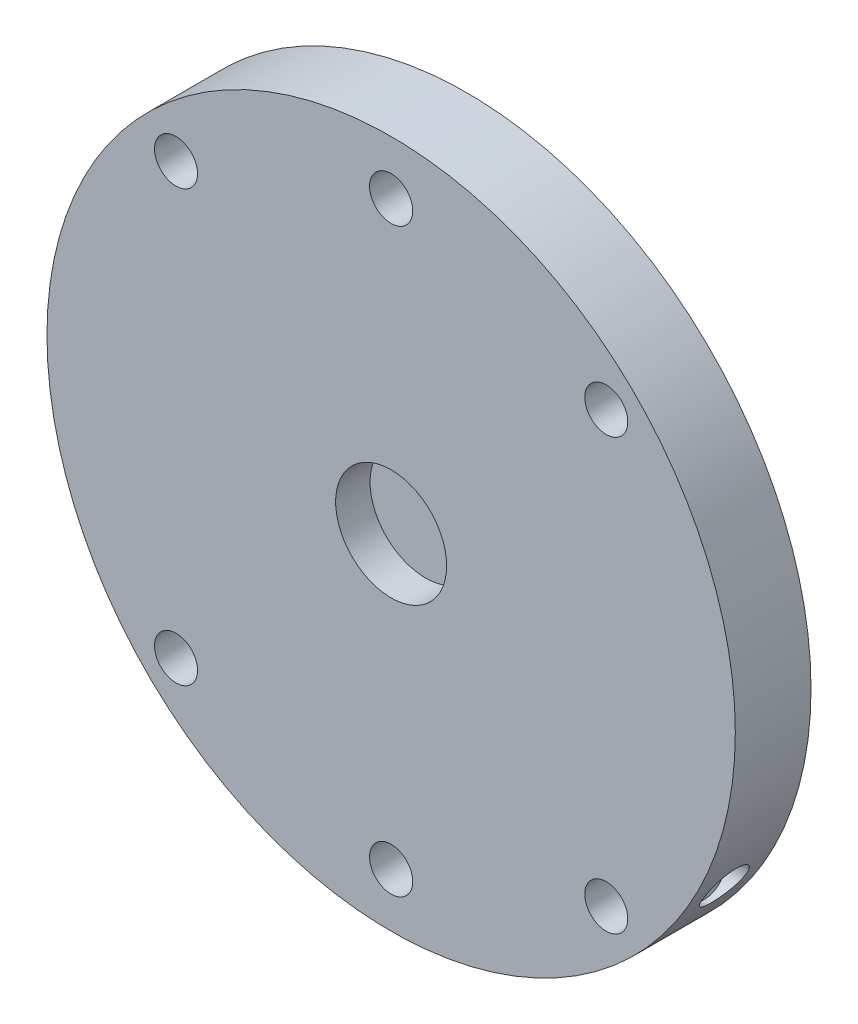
ISO-10303-21;
HEADER;
FILE_DESCRIPTION(('STEP AP214'),'2;1');
FILE_NAME('part.step','',(''),(''),'','','');
FILE_SCHEMA(('AUTOMOTIVE_DESIGN { 1 0 10303 214 1 1 1 1 }'));
ENDSEC;
DATA;
#1=APPLICATION_CONTEXT('core data for automotive mechanical design processes');
#2=APPLICATION_PROTOCOL_DEFINITION('international standard','automotive_design',2000,#1);
#3=PRODUCT_CONTEXT('',#1,'mechanical');
#4=PRODUCT('Part','Part','',(#3));
#5=PRODUCT_RELATED_PRODUCT_CATEGORY('part','',(#4));
#6=PRODUCT_DEFINITION_FORMATION('','',#4);
#7=PRODUCT_DEFINITION_CONTEXT('part definition',#1,'design');
#8=PRODUCT_DEFINITION('design','',#6,#7);
#9=PRODUCT_DEFINITION_SHAPE('','',#8);
#10=(LENGTH_UNIT() NAMED_UNIT(*) SI_UNIT(.MILLI.,.METRE.));
#11=(NAMED_UNIT(*) PLANE_ANGLE_UNIT() SI_UNIT($,.RADIAN.));
#12=(NAMED_UNIT(*) SI_UNIT($,.STERADIAN.) SOLID_ANGLE_UNIT());
#13=UNCERTAINTY_MEASURE_WITH_UNIT(LENGTH_MEASURE(1.E-05),#10,'distance_accuracy_value','');
#14=(GEOMETRIC_REPRESENTATION_CONTEXT(3) GLOBAL_UNCERTAINTY_ASSIGNED_CONTEXT((#13)) GLOBAL_UNIT_ASSIGNED_CONTEXT((#10,
#11,#12)) REPRESENTATION_CONTEXT('',''));
#15=CARTESIAN_POINT('',(0.,0.,0.));
#16=DIRECTION('',(0.,0.,1.));
#17=DIRECTION('',(1.,0.,0.));
#18=AXIS2_PLACEMENT_3D('',#15,#16,#17);
#19=CARTESIAN_POINT('',(33.02,-26.0350000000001,0.));
#20=DIRECTION('',(1.,0.,0.));
#21=DIRECTION('',(0.,0.,-1.));
#22=AXIS2_PLACEMENT_3D('',#19,#20,#21);
#23=PLANE('',#22);
#24=DIRECTION('',(0.,-0.49999999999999,-0.866025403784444));
#25=VECTOR('',#24,1.);
#26=CARTESIAN_POINT('',(33.02,-26.5430000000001,0.879881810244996));
#27=LINE('',#26,#25);
#28=CARTESIAN_POINT('',(33.02,-26.5430000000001,0.879881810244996));
#29=VERTEX_POINT('',#28);
#30=CARTESIAN_POINT('',(33.02,-27.051,0.));
#31=VERTEX_POINT('',#30);
#32=EDGE_CURVE('E143',#29,#31,#27,.T.);
#33=ORIENTED_EDGE('',*,*,#32,.T.);
#34=DIRECTION('',(0.,0.500000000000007,-0.866025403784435));
#35=VECTOR('',#34,1.);
#36=CARTESIAN_POINT('',(33.02,-27.051,0.));
#37=LINE('',#36,#35);
#38=CARTESIAN_POINT('',(33.02,-26.543,-0.879881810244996));
#39=VERTEX_POINT('',#38);
#40=EDGE_CURVE('E141',#31,#39,#37,.T.);
#41=ORIENTED_EDGE('',*,*,#40,.T.);
#42=DIRECTION('',(0.,1.,0.));
#43=VECTOR('',#42,1.);
#44=CARTESIAN_POINT('',(33.02,-26.543,-0.879881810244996));
#45=LINE('',#44,#43);
#46=CARTESIAN_POINT('',(33.02,-25.5270000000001,-0.879881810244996));
#47=VERTEX_POINT('',#46);
#48=EDGE_CURVE('E128',#39,#47,#45,.T.);
#49=ORIENTED_EDGE('',*,*,#48,.T.);
#50=DIRECTION('',(0.,0.500000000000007,0.866025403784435));
#51=VECTOR('',#50,1.);
#52=CARTESIAN_POINT('',(33.02,-25.5270000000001,-0.879881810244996));
#53=LINE('',#52,#51);
#54=CARTESIAN_POINT('',(33.02,-25.0190000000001,0.));
#55=VERTEX_POINT('',#54);
#56=EDGE_CURVE('E166',#47,#55,#53,.T.);
#57=ORIENTED_EDGE('',*,*,#56,.T.);
#58=DIRECTION('',(0.,-0.500000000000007,0.866025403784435));
#59=VECTOR('',#58,1.);
#60=CARTESIAN_POINT('',(33.02,-25.0190000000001,0.));
#61=LINE('',#60,#59);
#62=CARTESIAN_POINT('',(33.02,-25.5270000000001,0.879881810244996));
#63=VERTEX_POINT('',#62);
#64=EDGE_CURVE('E161',#55,#63,#61,.T.);
#65=ORIENTED_EDGE('',*,*,#64,.T.);
#66=DIRECTION('',(0.,1.,0.));
#67=VECTOR('',#66,1.);
#68=CARTESIAN_POINT('',(33.02,-25.5270000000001,0.879881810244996));
#69=LINE('',#68,#67);
#70=EDGE_CURVE('E157',#63,#29,#69,.F.);
#71=ORIENTED_EDGE('',*,*,#70,.T.);
#72=EDGE_LOOP('',(#33,#41,#49,#57,#65,#71));
#73=FACE_BOUND('',#72,.T.);
#74=ADVANCED_FACE('F32',(#73),#23,.T.);
#75=CARTESIAN_POINT('',(35.56,-26.543,-0.879881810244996));
#76=DIRECTION('',(0.,0.,-1.));
#77=DIRECTION('',(-1.,0.,0.));
#78=AXIS2_PLACEMENT_3D('',#75,#76,#77);
#79=PLANE('',#78);
#80=DIRECTION('',(1.,0.,0.));
#81=VECTOR('',#80,1.);
#82=CARTESIAN_POINT('',(35.56,-26.543,-0.879881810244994));
#83=LINE('',#82,#81);
#84=CARTESIAN_POINT('',(35.56,-26.543,-0.879881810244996));
#85=VERTEX_POINT('',#84);
#86=EDGE_CURVE('E132',#39,#85,#83,.T.);
#87=ORIENTED_EDGE('',*,*,#86,.T.);
#88=DIRECTION('',(0.,1.,0.));
#89=VECTOR('',#88,1.);
#90=CARTESIAN_POINT('',(35.56,-26.2197272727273,-0.879881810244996));
#91=LINE('',#90,#89);
#92=CARTESIAN_POINT('',(35.56,-25.5270000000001,-0.879881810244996));
#93=VERTEX_POINT('',#92);
#94=EDGE_CURVE('E168',#93,#85,#91,.F.);
#95=ORIENTED_EDGE('',*,*,#94,.F.);
#96=DIRECTION('',(1.,0.,0.));
#97=VECTOR('',#96,1.);
#98=CARTESIAN_POINT('',(35.56,-25.5270000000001,-0.879881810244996));
#99=LINE('',#98,#97);
#100=EDGE_CURVE('E135',#93,#47,#99,.F.);
#101=ORIENTED_EDGE('',*,*,#100,.T.);
#102=ORIENTED_EDGE('',*,*,#48,.F.);
#103=EDGE_LOOP('',(#87,#95,#101,#102));
#104=FACE_BOUND('',#103,.T.);
#105=ADVANCED_FACE('F130',(#104),#79,.F.);
#106=CARTESIAN_POINT('',(35.56,-27.051,0.));
#107=DIRECTION('',(0.,-0.866025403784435,-0.500000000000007));
#108=DIRECTION('',(0.,0.500000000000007,-0.866025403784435));
#109=AXIS2_PLACEMENT_3D('',#106,#107,#108);
#110=PLANE('',#109);
#111=DIRECTION('',(1.,0.,0.));
#112=VECTOR('',#111,1.);
#113=CARTESIAN_POINT('',(35.56,-27.0510000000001,0.));
#114=LINE('',#113,#112);
#115=CARTESIAN_POINT('',(35.56,-27.051,0.));
#116=VERTEX_POINT('',#115);
#117=EDGE_CURVE('E146',#31,#116,#114,.T.);
#118=ORIENTED_EDGE('',*,*,#117,.T.);
#119=DIRECTION('',(0.,-0.500000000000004,0.866025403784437));
#120=VECTOR('',#119,1.);
#121=CARTESIAN_POINT('',(35.56,-26.543,-0.879881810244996));
#122=LINE('',#121,#120);
#123=EDGE_CURVE('E150',#85,#116,#122,.T.);
#124=ORIENTED_EDGE('',*,*,#123,.F.);
#125=ORIENTED_EDGE('',*,*,#86,.F.);
#126=ORIENTED_EDGE('',*,*,#40,.F.);
#127=EDGE_LOOP('',(#118,#124,#125,#126));
#128=FACE_BOUND('',#127,.T.);
#129=ADVANCED_FACE('F148',(#128),#110,.F.);
#130=CARTESIAN_POINT('',(35.56,-26.5430000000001,0.879881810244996));
#131=DIRECTION('',(0.,-0.866025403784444,0.49999999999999));
#132=DIRECTION('',(0.,-0.49999999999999,-0.866025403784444));
#133=AXIS2_PLACEMENT_3D('',#130,#131,#132);
#134=PLANE('',#133);
#135=DIRECTION('',(1.,0.,0.));
#136=VECTOR('',#135,1.);
#137=CARTESIAN_POINT('',(35.56,-26.5430000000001,0.879881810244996));
#138=LINE('',#137,#136);
#139=CARTESIAN_POINT('',(35.56,-26.5430000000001,0.879881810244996));
#140=VERTEX_POINT('',#139);
#141=EDGE_CURVE('E155',#29,#140,#138,.T.);
#142=ORIENTED_EDGE('',*,*,#141,.T.);
#143=DIRECTION('',(0.,0.499999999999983,0.866025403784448));
#144=VECTOR('',#143,1.);
#145=CARTESIAN_POINT('',(35.56,-27.051,0.));
#146=LINE('',#145,#144);
#147=EDGE_CURVE('E181',#116,#140,#146,.T.);
#148=ORIENTED_EDGE('',*,*,#147,.F.);
#149=ORIENTED_EDGE('',*,*,#117,.F.);
#150=ORIENTED_EDGE('',*,*,#32,.F.);
#151=EDGE_LOOP('',(#142,#148,#149,#150));
#152=FACE_BOUND('',#151,.T.);
#153=ADVANCED_FACE('F567',(#152),#134,.F.);
#154=CARTESIAN_POINT('',(35.56,-25.5270000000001,0.879881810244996));
#155=DIRECTION('',(0.,0.,1.));
#156=DIRECTION('',(1.,0.,0.));
#157=AXIS2_PLACEMENT_3D('',#154,#155,#156);
#158=PLANE('',#157);
#159=DIRECTION('',(1.,0.,0.));
#160=VECTOR('',#159,1.);
#161=CARTESIAN_POINT('',(35.56,-25.5270000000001,0.879881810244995));
#162=LINE('',#161,#160);
#163=CARTESIAN_POINT('',(35.56,-25.5270000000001,0.879881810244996));
#164=VERTEX_POINT('',#163);
#165=EDGE_CURVE('E159',#63,#164,#162,.T.);
#166=ORIENTED_EDGE('',*,*,#165,.T.);
#167=DIRECTION('',(0.,1.,0.));
#168=VECTOR('',#167,1.);
#169=CARTESIAN_POINT('',(35.56,-26.2197272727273,0.879881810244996));
#170=LINE('',#169,#168);
#171=EDGE_CURVE('E178',#140,#164,#170,.T.);
#172=ORIENTED_EDGE('',*,*,#171,.F.);
#173=ORIENTED_EDGE('',*,*,#141,.F.);
#174=ORIENTED_EDGE('',*,*,#70,.F.);
#175=EDGE_LOOP('',(#166,#172,#173,#174));
#176=FACE_BOUND('',#175,.T.);
#177=ADVANCED_FACE('F576',(#176),#158,.F.);
#178=CARTESIAN_POINT('',(35.56,-25.0190000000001,0.));
#179=DIRECTION('',(0.,0.866025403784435,0.500000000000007));
#180=DIRECTION('',(0.,-0.500000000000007,0.866025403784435));
#181=AXIS2_PLACEMENT_3D('',#178,#179,#180);
#182=PLANE('',#181);
#183=DIRECTION('',(1.,0.,0.));
#184=VECTOR('',#183,1.);
#185=CARTESIAN_POINT('',(35.56,-25.0190000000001,0.));
#186=LINE('',#185,#184);
#187=CARTESIAN_POINT('',(35.56,-25.0190000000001,0.));
#188=VERTEX_POINT('',#187);
#189=EDGE_CURVE('E164',#55,#188,#186,.T.);
#190=ORIENTED_EDGE('',*,*,#189,.T.);
#191=DIRECTION('',(0.,0.500000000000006,-0.866025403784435));
#192=VECTOR('',#191,1.);
#193=CARTESIAN_POINT('',(35.56,-25.5270000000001,0.879881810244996));
#194=LINE('',#193,#192);
#195=EDGE_CURVE('E175',#164,#188,#194,.T.);
#196=ORIENTED_EDGE('',*,*,#195,.F.);
#197=ORIENTED_EDGE('',*,*,#165,.F.);
#198=ORIENTED_EDGE('',*,*,#64,.F.);
#199=EDGE_LOOP('',(#190,#196,#197,#198));
#200=FACE_BOUND('',#199,.T.);
#201=ADVANCED_FACE('F586',(#200),#182,.F.);
#202=CARTESIAN_POINT('',(35.56,-25.5270000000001,-0.879881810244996));
#203=DIRECTION('',(0.,0.866025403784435,-0.500000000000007));
#204=DIRECTION('',(0.,0.500000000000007,0.866025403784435));
#205=AXIS2_PLACEMENT_3D('',#202,#203,#204);
#206=PLANE('',#205);
#207=ORIENTED_EDGE('',*,*,#100,.F.);
#208=DIRECTION('',(0.,-0.500000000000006,-0.866025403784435));
#209=VECTOR('',#208,1.);
#210=CARTESIAN_POINT('',(35.56,-25.0190000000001,0.));
#211=LINE('',#210,#209);
#212=EDGE_CURVE('E171',#188,#93,#211,.T.);
#213=ORIENTED_EDGE('',*,*,#212,.F.);
#214=ORIENTED_EDGE('',*,*,#189,.F.);
#215=ORIENTED_EDGE('',*,*,#56,.F.);
#216=EDGE_LOOP('',(#207,#213,#214,#215));
#217=FACE_BOUND('',#216,.T.);
#218=ADVANCED_FACE('F596',(#217),#206,.F.);
#219=CARTESIAN_POINT('',(-33.02,-25.019,0.879881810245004));
#220=DIRECTION('',(-1.,0.,0.));
#221=DIRECTION('',(0.,0.,-1.));
#222=AXIS2_PLACEMENT_3D('',#219,#220,#221);
#223=PLANE('',#222);
#224=DIRECTION('',(0.,0.500000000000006,-0.866025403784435));
#225=VECTOR('',#224,1.);
#226=CARTESIAN_POINT('',(-33.02,-25.273,0.439940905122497));
#227=LINE('',#226,#225);
#228=CARTESIAN_POINT('',(-33.02,-25.527,0.879881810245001));
#229=VERTEX_POINT('',#228);
#230=CARTESIAN_POINT('',(-33.02,-25.0190000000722,1.25000470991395E-10));
#231=VERTEX_POINT('',#230);
#232=EDGE_CURVE('E191',#229,#231,#227,.T.);
#233=ORIENTED_EDGE('',*,*,#232,.T.);
#234=DIRECTION('',(0.,-0.500000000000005,-0.866025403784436));
#235=VECTOR('',#234,1.);
#236=CARTESIAN_POINT('',(-33.02,-25.273,-0.439940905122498));
#237=LINE('',#236,#235);
#238=CARTESIAN_POINT('',(-33.02,-25.527,-0.879881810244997));
#239=VERTEX_POINT('',#238);
#240=EDGE_CURVE('E187',#231,#239,#237,.T.);
#241=ORIENTED_EDGE('',*,*,#240,.T.);
#242=DIRECTION('',(0.,-1.,0.));
#243=VECTOR('',#242,1.);
#244=CARTESIAN_POINT('',(-33.02,-26.035,-0.879881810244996));
#245=LINE('',#244,#243);
#246=CARTESIAN_POINT('',(-33.02,-26.543,-0.879881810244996));
#247=VERTEX_POINT('',#246);
#248=EDGE_CURVE('E174',#239,#247,#245,.T.);
#249=ORIENTED_EDGE('',*,*,#248,.T.);
#250=DIRECTION('',(0.,-0.500000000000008,0.866025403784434));
#251=VECTOR('',#250,1.);
#252=CARTESIAN_POINT('',(-33.02,-26.797,-0.439940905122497));
#253=LINE('',#252,#251);
#254=CARTESIAN_POINT('',(-33.02,-27.0509999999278,-1.25004905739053E-10));
#255=VERTEX_POINT('',#254);
#256=EDGE_CURVE('E202',#247,#255,#253,.T.);
#257=ORIENTED_EDGE('',*,*,#256,.T.);
#258=DIRECTION('',(0.,0.499999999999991,0.866025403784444));
#259=VECTOR('',#258,1.);
#260=CARTESIAN_POINT('',(-33.02,-26.797,0.439940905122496));
#261=LINE('',#260,#259);
#262=CARTESIAN_POINT('',(-33.02,-26.543,0.879881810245));
#263=VERTEX_POINT('',#262);
#264=EDGE_CURVE('E199',#255,#263,#261,.T.);
#265=ORIENTED_EDGE('',*,*,#264,.T.);
#266=DIRECTION('',(0.,1.,0.));
#267=VECTOR('',#266,1.);
#268=CARTESIAN_POINT('',(-33.02,-26.035,0.879881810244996));
#269=LINE('',#268,#267);
#270=EDGE_CURVE('E195',#263,#229,#269,.T.);
#271=ORIENTED_EDGE('',*,*,#270,.T.);
#272=EDGE_LOOP('',(#233,#241,#249,#257,#265,#271));
#273=FACE_BOUND('',#272,.T.);
#274=ADVANCED_FACE('F236',(#273),#223,.T.);
#275=CARTESIAN_POINT('',(35.56,-26.2197272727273,0.));
#276=DIRECTION('',(1.,0.,0.));
#277=DIRECTION('',(0.,0.,-1.));
#278=AXIS2_PLACEMENT_3D('',#275,#276,#277);
#279=PLANE('',#278);
#280=ORIENTED_EDGE('',*,*,#195,.T.);
#281=ORIENTED_EDGE('',*,*,#212,.T.);
#282=ORIENTED_EDGE('',*,*,#94,.T.);
#283=ORIENTED_EDGE('',*,*,#123,.T.);
#284=ORIENTED_EDGE('',*,*,#147,.T.);
#285=ORIENTED_EDGE('',*,*,#171,.T.);
#286=EDGE_LOOP('',(#280,#281,#282,#283,#284,#285));
#287=FACE_BOUND('',#286,.T.);
#288=CARTESIAN_POINT('',(35.56,-26.0350000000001,0.));
#289=DIRECTION('',(-1.,0.,0.));
#290=DIRECTION('',(0.,0.,1.));
#291=AXIS2_PLACEMENT_3D('',#288,#289,#290);
#292=CIRCLE('',#291,2.032);
#293=CARTESIAN_POINT('',(35.56,-26.0350000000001,2.032));
#294=VERTEX_POINT('',#293);
#295=EDGE_CURVE('E205',#294,#294,#292,.F.);
#296=ORIENTED_EDGE('',*,*,#295,.T.);
#297=EDGE_LOOP('',(#296));
#298=FACE_BOUND('',#297,.T.);
#299=ADVANCED_FACE('F390',(#287,#298),#279,.T.);
#300=CARTESIAN_POINT('',(15.7249090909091,-28.575,0.));
#301=DIRECTION('',(0.,1.,0.));
#302=DIRECTION('',(0.,0.,1.));
#303=AXIS2_PLACEMENT_3D('',#300,#301,#302);
#304=PLANE('',#303);
#305=CARTESIAN_POINT('',(16.002,-28.575,0.));
#306=DIRECTION('',(0.,1.,0.));
#307=DIRECTION('',(0.,0.,1.));
#308=AXIS2_PLACEMENT_3D('',#305,#306,#307);
#309=CIRCLE('',#308,3.048);
#310=CARTESIAN_POINT('',(16.002,-28.575,3.048));
#311=VERTEX_POINT('',#310);
#312=EDGE_CURVE('E216',#311,#311,#309,.F.);
#313=ORIENTED_EDGE('',*,*,#312,.T.);
#314=EDGE_LOOP('',(#313));
#315=FACE_BOUND('',#314,.T.);
#316=ADVANCED_FACE('F410',(#315),#304,.F.);
#317=CARTESIAN_POINT('',(-35.56,-25.527,-0.879881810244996));
#318=DIRECTION('',(0.,0.,-1.));
#319=DIRECTION('',(1.,0.,0.));
#320=AXIS2_PLACEMENT_3D('',#317,#318,#319);
#321=PLANE('',#320);
#322=DIRECTION('',(-1.,0.,0.));
#323=VECTOR('',#322,1.);
#324=CARTESIAN_POINT('',(-34.29,-25.527,-0.879881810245));
#325=LINE('',#324,#323);
#326=CARTESIAN_POINT('',(-35.56,-25.527,-0.879881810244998));
#327=VERTEX_POINT('',#326);
#328=EDGE_CURVE('E67',#239,#327,#325,.T.);
#329=ORIENTED_EDGE('',*,*,#328,.T.);
#330=DIRECTION('',(0.,1.,0.));
#331=VECTOR('',#330,1.);
#332=CARTESIAN_POINT('',(-35.56,-26.035,-0.879881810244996));
#333=LINE('',#332,#331);
#334=CARTESIAN_POINT('',(-35.56,-26.543,-0.879881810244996));
#335=VERTEX_POINT('',#334);
#336=EDGE_CURVE('E73',#335,#327,#333,.T.);
#337=ORIENTED_EDGE('',*,*,#336,.F.);
#338=DIRECTION('',(1.,0.,0.));
#339=VECTOR('',#338,1.);
#340=CARTESIAN_POINT('',(-34.29,-26.543,-0.879881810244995));
#341=LINE('',#340,#339);
#342=EDGE_CURVE('E206',#335,#247,#341,.T.);
#343=ORIENTED_EDGE('',*,*,#342,.T.);
#344=ORIENTED_EDGE('',*,*,#248,.F.);
#345=EDGE_LOOP('',(#329,#337,#343,#344));
#346=FACE_BOUND('',#345,.T.);
#347=ADVANCED_FACE('F631',(#346),#321,.F.);
#348=CARTESIAN_POINT('',(-35.56,-25.019,0.));
#349=DIRECTION('',(0.,0.866025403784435,-0.500000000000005));
#350=DIRECTION('',(1.,0.,0.));
#351=AXIS2_PLACEMENT_3D('',#348,#349,#350);
#352=PLANE('',#351);
#353=DIRECTION('',(-1.,0.,0.));
#354=VECTOR('',#353,1.);
#355=CARTESIAN_POINT('',(-34.29,-25.019,0.));
#356=LINE('',#355,#354);
#357=CARTESIAN_POINT('',(-35.56,-25.019,0.));
#358=VERTEX_POINT('',#357);
#359=EDGE_CURVE('E190',#231,#358,#356,.T.);
#360=ORIENTED_EDGE('',*,*,#359,.T.);
#361=DIRECTION('',(0.,0.500000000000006,0.866025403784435));
#362=VECTOR('',#361,1.);
#363=CARTESIAN_POINT('',(-35.56,-25.527,-0.879881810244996));
#364=LINE('',#363,#362);
#365=EDGE_CURVE('E215',#327,#358,#364,.T.);
#366=ORIENTED_EDGE('',*,*,#365,.F.);
#367=ORIENTED_EDGE('',*,*,#328,.F.);
#368=ORIENTED_EDGE('',*,*,#240,.F.);
#369=EDGE_LOOP('',(#360,#366,#367,#368));
#370=FACE_BOUND('',#369,.T.);
#371=ADVANCED_FACE('F640',(#370),#352,.F.);
#372=CARTESIAN_POINT('',(-33.02,-25.019,0.));
#373=DIRECTION('',(0.,0.866025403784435,0.500000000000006));
#374=DIRECTION('',(-1.,0.,0.));
#375=AXIS2_PLACEMENT_3D('',#372,#373,#374);
#376=PLANE('',#375);
#377=DIRECTION('',(-1.,0.,0.));
#378=VECTOR('',#377,1.);
#379=CARTESIAN_POINT('',(-34.29,-25.527,0.879881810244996));
#380=LINE('',#379,#378);
#381=CARTESIAN_POINT('',(-35.56,-25.527,0.879881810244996));
#382=VERTEX_POINT('',#381);
#383=EDGE_CURVE('E194',#229,#382,#380,.T.);
#384=ORIENTED_EDGE('',*,*,#383,.T.);
#385=DIRECTION('',(0.,-0.500000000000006,0.866025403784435));
#386=VECTOR('',#385,1.);
#387=CARTESIAN_POINT('',(-35.56,-25.019,0.));
#388=LINE('',#387,#386);
#389=EDGE_CURVE('E212',#358,#382,#388,.T.);
#390=ORIENTED_EDGE('',*,*,#389,.F.);
#391=ORIENTED_EDGE('',*,*,#359,.F.);
#392=ORIENTED_EDGE('',*,*,#232,.F.);
#393=EDGE_LOOP('',(#384,#390,#391,#392));
#394=FACE_BOUND('',#393,.T.);
#395=ADVANCED_FACE('F648',(#394),#376,.F.);
#396=CARTESIAN_POINT('',(-33.02,-25.527,0.879881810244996));
#397=DIRECTION('',(0.,0.,1.));
#398=DIRECTION('',(-1.,0.,0.));
#399=AXIS2_PLACEMENT_3D('',#396,#397,#398);
#400=PLANE('',#399);
#401=DIRECTION('',(-1.,0.,0.));
#402=VECTOR('',#401,1.);
#403=CARTESIAN_POINT('',(-34.29,-26.543,0.879881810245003));
#404=LINE('',#403,#402);
#405=CARTESIAN_POINT('',(-35.56,-26.543,0.879881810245));
#406=VERTEX_POINT('',#405);
#407=EDGE_CURVE('E198',#263,#406,#404,.T.);
#408=ORIENTED_EDGE('',*,*,#407,.T.);
#409=DIRECTION('',(0.,-1.,0.));
#410=VECTOR('',#409,1.);
#411=CARTESIAN_POINT('',(-35.56,-26.035,0.879881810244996));
#412=LINE('',#411,#410);
#413=EDGE_CURVE('E208',#382,#406,#412,.T.);
#414=ORIENTED_EDGE('',*,*,#413,.F.);
#415=ORIENTED_EDGE('',*,*,#383,.F.);
#416=ORIENTED_EDGE('',*,*,#270,.F.);
#417=EDGE_LOOP('',(#408,#414,#415,#416));
#418=FACE_BOUND('',#417,.T.);
#419=ADVANCED_FACE('F658',(#418),#400,.F.);
#420=CARTESIAN_POINT('',(-35.56,-26.543,0.879881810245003));
#421=DIRECTION('',(0.,-0.866025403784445,0.499999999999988));
#422=DIRECTION('',(0.,-0.499999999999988,-0.866025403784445));
#423=AXIS2_PLACEMENT_3D('',#420,#421,#422);
#424=PLANE('',#423);
#425=DIRECTION('',(-1.,0.,0.));
#426=VECTOR('',#425,1.);
#427=CARTESIAN_POINT('',(-34.29,-27.051,0.));
#428=LINE('',#427,#426);
#429=CARTESIAN_POINT('',(-35.56,-27.051,0.));
#430=VERTEX_POINT('',#429);
#431=EDGE_CURVE('E52',#255,#430,#428,.T.);
#432=ORIENTED_EDGE('',*,*,#431,.T.);
#433=DIRECTION('',(0.,-0.500000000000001,-0.866025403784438));
#434=VECTOR('',#433,1.);
#435=CARTESIAN_POINT('',(-35.56,-26.543,0.879881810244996));
#436=LINE('',#435,#434);
#437=EDGE_CURVE('E211',#406,#430,#436,.T.);
#438=ORIENTED_EDGE('',*,*,#437,.F.);
#439=ORIENTED_EDGE('',*,*,#407,.F.);
#440=ORIENTED_EDGE('',*,*,#264,.F.);
#441=EDGE_LOOP('',(#432,#438,#439,#440));
#442=FACE_BOUND('',#441,.T.);
#443=ADVANCED_FACE('F405',(#442),#424,.F.);
#444=CARTESIAN_POINT('',(-35.56,-26.543,-0.879881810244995));
#445=DIRECTION('',(0.,-0.866025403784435,-0.500000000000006));
#446=DIRECTION('',(1.,0.,0.));
#447=AXIS2_PLACEMENT_3D('',#444,#445,#446);
#448=PLANE('',#447);
#449=ORIENTED_EDGE('',*,*,#342,.F.);
#450=DIRECTION('',(0.,0.500000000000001,-0.866025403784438));
#451=VECTOR('',#450,1.);
#452=CARTESIAN_POINT('',(-35.56,-27.051,0.));
#453=LINE('',#452,#451);
#454=EDGE_CURVE('E377',#430,#335,#453,.T.);
#455=ORIENTED_EDGE('',*,*,#454,.F.);
#456=ORIENTED_EDGE('',*,*,#431,.F.);
#457=ORIENTED_EDGE('',*,*,#256,.F.);
#458=EDGE_LOOP('',(#449,#455,#456,#457));
#459=FACE_BOUND('',#458,.T.);
#460=ADVANCED_FACE('F395',(#459),#448,.F.);
#461=CARTESIAN_POINT('',(40.64,-26.0350000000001,0.));
#462=DIRECTION('',(-1.,0.,0.));
#463=DIRECTION('',(0.,0.,1.));
#464=AXIS2_PLACEMENT_3D('',#461,#462,#463);
#465=CYLINDRICAL_SURFACE('',#464,2.032);
#466=CARTESIAN_POINT('',(40.64,-26.0350000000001,0.));
#467=DIRECTION('',(-1.,0.,0.));
#468=DIRECTION('',(0.,0.,1.));
#469=AXIS2_PLACEMENT_3D('',#466,#467,#468);
#470=CIRCLE('',#469,2.032);
#471=CARTESIAN_POINT('',(40.64,-26.0350000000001,2.032));
#472=VERTEX_POINT('',#471);
#473=EDGE_CURVE('E374',#472,#472,#470,.T.);
#474=ORIENTED_EDGE('',*,*,#473,.F.);
#475=EDGE_LOOP('',(#474));
#476=FACE_BOUND('',#475,.T.);
#477=ORIENTED_EDGE('',*,*,#295,.F.);
#478=EDGE_LOOP('',(#477));
#479=FACE_BOUND('',#478,.T.);
#480=ADVANCED_FACE('F392',(#476,#479),#465,.F.);
#481=CARTESIAN_POINT('',(16.002,-40.64,0.));
#482=DIRECTION('',(0.,1.,0.));
#483=DIRECTION('',(0.,0.,1.));
#484=AXIS2_PLACEMENT_3D('',#481,#482,#483);
#485=CYLINDRICAL_SURFACE('',#484,3.048);
#486=ORIENTED_EDGE('',*,*,#312,.F.);
#487=EDGE_LOOP('',(#486));
#488=FACE_BOUND('',#487,.T.);
#489=CARTESIAN_POINT('',(16.002,-40.64,0.));
#490=DIRECTION('',(0.,1.,0.));
#491=DIRECTION('',(0.,0.,1.));
#492=AXIS2_PLACEMENT_3D('',#489,#490,#491);
#493=CIRCLE('',#492,3.048);
#494=CARTESIAN_POINT('',(16.002,-40.64,3.048));
#495=VERTEX_POINT('',#494);
#496=EDGE_CURVE('E371',#495,#495,#493,.F.);
#497=ORIENTED_EDGE('',*,*,#496,.T.);
#498=EDGE_LOOP('',(#497));
#499=FACE_BOUND('',#498,.T.);
#500=ADVANCED_FACE('F394',(#488,#499),#485,.F.);
#501=CARTESIAN_POINT('',(-19.05,-28.575,-3.10896));
#502=DIRECTION('',(0.,1.,0.));
#503=DIRECTION('',(0.,0.,1.));
#504=AXIS2_PLACEMENT_3D('',#501,#502,#503);
#505=PLANE('',#504);
#506=CARTESIAN_POINT('',(-16.002,-28.575,0.));
#507=DIRECTION('',(0.,1.,0.));
#508=DIRECTION('',(0.,0.,1.));
#509=AXIS2_PLACEMENT_3D('',#506,#507,#508);
#510=CIRCLE('',#509,3.048);
#511=CARTESIAN_POINT('',(-16.002,-28.575,3.048));
#512=VERTEX_POINT('',#511);
#513=EDGE_CURVE('E368',#512,#512,#510,.F.);
#514=ORIENTED_EDGE('',*,*,#513,.T.);
#515=EDGE_LOOP('',(#514));
#516=FACE_BOUND('',#515,.T.);
#517=ADVANCED_FACE('F402',(#516),#505,.F.);
#518=CARTESIAN_POINT('',(-35.56,-24.003,2.07264));
#519=DIRECTION('',(-1.,0.,0.));
#520=DIRECTION('',(0.,0.,-1.));
#521=AXIS2_PLACEMENT_3D('',#518,#519,#520);
#522=PLANE('',#521);
#523=ORIENTED_EDGE('',*,*,#437,.T.);
#524=ORIENTED_EDGE('',*,*,#454,.T.);
#525=ORIENTED_EDGE('',*,*,#336,.T.);
#526=ORIENTED_EDGE('',*,*,#365,.T.);
#527=ORIENTED_EDGE('',*,*,#389,.T.);
#528=ORIENTED_EDGE('',*,*,#413,.T.);
#529=EDGE_LOOP('',(#523,#524,#525,#526,#527,#528));
#530=FACE_BOUND('',#529,.T.);
#531=CARTESIAN_POINT('',(-35.56,-26.035,0.));
#532=DIRECTION('',(1.,0.,0.));
#533=DIRECTION('',(0.,0.,-1.));
#534=AXIS2_PLACEMENT_3D('',#531,#532,#533);
#535=CIRCLE('',#534,2.032);
#536=CARTESIAN_POINT('',(-35.56,-26.035,-2.032));
#537=VERTEX_POINT('',#536);
#538=EDGE_CURVE('E362',#537,#537,#535,.F.);
#539=ORIENTED_EDGE('',*,*,#538,.T.);
#540=EDGE_LOOP('',(#539));
#541=FACE_BOUND('',#540,.T.);
#542=ADVANCED_FACE('F417',(#530,#541),#522,.T.);
#543=CARTESIAN_POINT('',(40.64,-26.3236363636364,0.));
#544=DIRECTION('',(1.,0.,0.));
#545=DIRECTION('',(0.,0.,-1.));
#546=AXIS2_PLACEMENT_3D('',#543,#544,#545);
#547=PLANE('',#546);
#548=ORIENTED_EDGE('',*,*,#473,.T.);
#549=EDGE_LOOP('',(#548));
#550=FACE_BOUND('',#549,.T.);
#551=CARTESIAN_POINT('',(40.64,-26.0350000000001,0.));
#552=DIRECTION('',(-1.,0.,0.));
#553=DIRECTION('',(0.,0.,1.));
#554=AXIS2_PLACEMENT_3D('',#551,#552,#553);
#555=CIRCLE('',#554,3.175);
#556=CARTESIAN_POINT('',(40.64,-26.0350000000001,3.175));
#557=VERTEX_POINT('',#556);
#558=EDGE_CURVE('E356',#557,#557,#555,.F.);
#559=ORIENTED_EDGE('',*,*,#558,.T.);
#560=EDGE_LOOP('',(#559));
#561=FACE_BOUND('',#560,.T.);
#562=ADVANCED_FACE('F413',(#550,#561),#547,.T.);
#563=CARTESIAN_POINT('',(15.6556363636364,-40.64,0.));
#564=DIRECTION('',(0.,1.,0.));
#565=DIRECTION('',(0.,0.,1.));
#566=AXIS2_PLACEMENT_3D('',#563,#564,#565);
#567=PLANE('',#566);
#568=ORIENTED_EDGE('',*,*,#496,.F.);
#569=EDGE_LOOP('',(#568));
#570=FACE_BOUND('',#569,.T.);
#571=CARTESIAN_POINT('',(16.002,-40.64,0.));
#572=DIRECTION('',(0.,1.,0.));
#573=DIRECTION('',(0.,0.,1.));
#574=AXIS2_PLACEMENT_3D('',#571,#572,#573);
#575=CIRCLE('',#574,3.81);
#576=CARTESIAN_POINT('',(16.002,-40.64,3.81));
#577=VERTEX_POINT('',#576);
#578=EDGE_CURVE('E353',#577,#577,#575,.F.);
#579=ORIENTED_EDGE('',*,*,#578,.T.);
#580=EDGE_LOOP('',(#579));
#581=FACE_BOUND('',#580,.T.);
#582=ADVANCED_FACE('F416',(#570,#581),#567,.F.);
#583=CARTESIAN_POINT('',(0.,0.744681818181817,0.50800000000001));
#584=DIRECTION('',(0.,0.,1.));
#585=DIRECTION('',(1.,0.,0.));
#586=AXIS2_PLACEMENT_3D('',#583,#584,#585);
#587=PLANE('',#586);
#588=CARTESIAN_POINT('',(0.,0.,0.50800000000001));
#589=DIRECTION('',(0.,0.,1.));
#590=DIRECTION('',(1.,0.,0.));
#591=AXIS2_PLACEMENT_3D('',#588,#589,#590);
#592=CIRCLE('',#591,8.1915);
#593=CARTESIAN_POINT('',(8.1915,0.,0.50800000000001));
#594=VERTEX_POINT('',#593);
#595=EDGE_CURVE('E355',#594,#594,#592,.T.);
#596=ORIENTED_EDGE('',*,*,#595,.T.);
#597=EDGE_LOOP('',(#596));
#598=FACE_BOUND('',#597,.T.);
#599=ADVANCED_FACE('F421',(#598),#587,.T.);
#600=CARTESIAN_POINT('',(0.,43.1522909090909,-2.53999999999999));
#601=DIRECTION('',(0.,0.,1.));
#602=DIRECTION('',(1.,0.,0.));
#603=AXIS2_PLACEMENT_3D('',#600,#601,#602);
#604=PLANE('',#603);
#605=CARTESIAN_POINT('',(0.,42.8625,-2.54));
#606=DIRECTION('',(0.,0.,1.));
#607=DIRECTION('',(1.,0.,0.));
#608=AXIS2_PLACEMENT_3D('',#605,#606,#607);
#609=CIRCLE('',#608,3.1877);
#610=CARTESIAN_POINT('',(3.1877,42.8625,-2.54));
#611=VERTEX_POINT('',#610);
#612=EDGE_CURVE('E359',#611,#611,#609,.T.);
#613=ORIENTED_EDGE('',*,*,#612,.T.);
#614=EDGE_LOOP('',(#613));
#615=FACE_BOUND('',#614,.T.);
#616=ADVANCED_FACE('F425',(#615),#604,.T.);
#617=CARTESIAN_POINT('',(31.75,32.0386363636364,-3.81));
#618=DIRECTION('',(0.,0.,1.));
#619=DIRECTION('',(1.,0.,0.));
#620=AXIS2_PLACEMENT_3D('',#617,#618,#619);
#621=PLANE('',#620);
#622=CARTESIAN_POINT('',(31.75,31.75,-3.81));
#623=DIRECTION('',(0.,0.,-1.));
#624=DIRECTION('',(-1.,0.,0.));
#625=AXIS2_PLACEMENT_3D('',#622,#623,#624);
#626=CIRCLE('',#625,3.175);
#627=CARTESIAN_POINT('',(28.575,31.75,-3.81));
#628=VERTEX_POINT('',#627);
#629=EDGE_CURVE('E465',#628,#628,#626,.F.);
#630=ORIENTED_EDGE('',*,*,#629,.T.);
#631=EDGE_LOOP('',(#630));
#632=FACE_BOUND('',#631,.T.);
#633=ADVANCED_FACE('F429',(#632),#621,.T.);
#634=CARTESIAN_POINT('',(-31.75,32.0386363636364,-3.81));
#635=DIRECTION('',(0.,0.,1.));
#636=DIRECTION('',(1.,0.,0.));
#637=AXIS2_PLACEMENT_3D('',#634,#635,#636);
#638=PLANE('',#637);
#639=CARTESIAN_POINT('',(-31.75,31.75,-3.81));
#640=DIRECTION('',(0.,0.,-1.));
#641=DIRECTION('',(-1.,0.,0.));
#642=AXIS2_PLACEMENT_3D('',#639,#640,#641);
#643=CIRCLE('',#642,3.175);
#644=CARTESIAN_POINT('',(-34.925,31.75,-3.81));
#645=VERTEX_POINT('',#644);
#646=EDGE_CURVE('E460',#645,#645,#643,.F.);
#647=ORIENTED_EDGE('',*,*,#646,.T.);
#648=EDGE_LOOP('',(#647));
#649=FACE_BOUND('',#648,.T.);
#650=ADVANCED_FACE('F433',(#649),#638,.T.);
#651=CARTESIAN_POINT('',(0.,-43.1522909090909,-2.53999999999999));
#652=DIRECTION('',(0.,0.,1.));
#653=DIRECTION('',(1.,0.,0.));
#654=AXIS2_PLACEMENT_3D('',#651,#652,#653);
#655=PLANE('',#654);
#656=CARTESIAN_POINT('',(0.,-42.8625,-2.54));
#657=DIRECTION('',(0.,0.,1.));
#658=DIRECTION('',(1.,0.,0.));
#659=AXIS2_PLACEMENT_3D('',#656,#657,#658);
#660=CIRCLE('',#659,3.1877);
#661=CARTESIAN_POINT('',(3.1877,-42.8625,-2.54));
#662=VERTEX_POINT('',#661);
#663=EDGE_CURVE('E454',#662,#662,#660,.T.);
#664=ORIENTED_EDGE('',*,*,#663,.T.);
#665=EDGE_LOOP('',(#664));
#666=FACE_BOUND('',#665,.T.);
#667=ADVANCED_FACE('F437',(#666),#655,.T.);
#668=CARTESIAN_POINT('',(31.75,-31.4613636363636,-3.81));
#669=DIRECTION('',(0.,0.,1.));
#670=DIRECTION('',(1.,0.,0.));
#671=AXIS2_PLACEMENT_3D('',#668,#669,#670);
#672=PLANE('',#671);
#673=CARTESIAN_POINT('',(31.75,-31.75,-3.81));
#674=DIRECTION('',(0.,0.,-1.));
#675=DIRECTION('',(-1.,0.,0.));
#676=AXIS2_PLACEMENT_3D('',#673,#674,#675);
#677=CIRCLE('',#676,3.175);
#678=CARTESIAN_POINT('',(28.575,-31.75,-3.81));
#679=VERTEX_POINT('',#678);
#680=EDGE_CURVE('E451',#679,#679,#677,.F.);
#681=ORIENTED_EDGE('',*,*,#680,.T.);
#682=EDGE_LOOP('',(#681));
#683=FACE_BOUND('',#682,.T.);
#684=ADVANCED_FACE('F440',(#683),#672,.T.);
#685=CARTESIAN_POINT('',(-31.75,-31.4613636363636,-3.81));
#686=DIRECTION('',(0.,0.,1.));
#687=DIRECTION('',(1.,0.,0.));
#688=AXIS2_PLACEMENT_3D('',#685,#686,#687);
#689=PLANE('',#688);
#690=CARTESIAN_POINT('',(-31.75,-31.75,-3.81));
#691=DIRECTION('',(0.,0.,-1.));
#692=DIRECTION('',(-1.,0.,0.));
#693=AXIS2_PLACEMENT_3D('',#690,#691,#692);
#694=CIRCLE('',#693,3.175);
#695=CARTESIAN_POINT('',(-34.925,-31.75,-3.81));
#696=VERTEX_POINT('',#695);
#697=EDGE_CURVE('E453',#696,#696,#694,.F.);
#698=ORIENTED_EDGE('',*,*,#697,.T.);
#699=EDGE_LOOP('',(#698));
#700=FACE_BOUND('',#699,.T.);
#701=ADVANCED_FACE('F263',(#700),#689,.T.);
#702=CARTESIAN_POINT('',(-16.002,-40.64,0.));
#703=DIRECTION('',(0.,1.,0.));
#704=DIRECTION('',(0.,0.,1.));
#705=AXIS2_PLACEMENT_3D('',#702,#703,#704);
#706=CYLINDRICAL_SURFACE('',#705,3.048);
#707=ORIENTED_EDGE('',*,*,#513,.F.);
#708=EDGE_LOOP('',(#707));
#709=FACE_BOUND('',#708,.T.);
#710=CARTESIAN_POINT('',(-16.002,-40.64,0.));
#711=DIRECTION('',(0.,1.,0.));
#712=DIRECTION('',(0.,0.,1.));
#713=AXIS2_PLACEMENT_3D('',#710,#711,#712);
#714=CIRCLE('',#713,3.048);
#715=CARTESIAN_POINT('',(-16.002,-40.64,3.048));
#716=VERTEX_POINT('',#715);
#717=EDGE_CURVE('E457',#716,#716,#714,.F.);
#718=ORIENTED_EDGE('',*,*,#717,.T.);
#719=EDGE_LOOP('',(#718));
#720=FACE_BOUND('',#719,.T.);
#721=ADVANCED_FACE('F447',(#709,#720),#706,.F.);
#722=CARTESIAN_POINT('',(-40.64,-26.035,0.));
#723=DIRECTION('',(1.,0.,0.));
#724=DIRECTION('',(0.,0.,-1.));
#725=AXIS2_PLACEMENT_3D('',#722,#723,#724);
#726=CYLINDRICAL_SURFACE('',#725,2.032);
#727=ORIENTED_EDGE('',*,*,#538,.F.);
#728=EDGE_LOOP('',(#727));
#729=FACE_BOUND('',#728,.T.);
#730=CARTESIAN_POINT('',(-40.64,-26.035,0.));
#731=DIRECTION('',(1.,0.,0.));
#732=DIRECTION('',(0.,0.,-1.));
#733=AXIS2_PLACEMENT_3D('',#730,#731,#732);
#734=CIRCLE('',#733,2.032);
#735=CARTESIAN_POINT('',(-40.64,-26.035,-2.032));
#736=VERTEX_POINT('',#735);
#737=EDGE_CURVE('E254',#736,#736,#734,.T.);
#738=ORIENTED_EDGE('',*,*,#737,.F.);
#739=EDGE_LOOP('',(#738));
#740=FACE_BOUND('',#739,.T.);
#741=ADVANCED_FACE('F261',(#729,#740),#726,.F.);
#742=CARTESIAN_POINT('',(45.3942056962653,-26.0350000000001,0.));
#743=DIRECTION('',(-1.,0.,0.));
#744=DIRECTION('',(0.,0.,1.));
#745=AXIS2_PLACEMENT_3D('',#742,#743,#744);
#746=CYLINDRICAL_SURFACE('',#745,3.175);
#747=CARTESIAN_POINT('',(45.365850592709,-22.8600000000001,0.));
#748=CARTESIAN_POINT('',(45.3658468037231,-22.8600089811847,-0.163659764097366));
#749=CARTESIAN_POINT('',(45.3594422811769,-22.8727310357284,-0.327574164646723));
#750=CARTESIAN_POINT('',(45.3340148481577,-22.9230857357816,-0.650753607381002));
#751=CARTESIAN_POINT('',(45.3149627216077,-22.9607760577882,-0.810006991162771));
#752=CARTESIAN_POINT('',(45.2649452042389,-23.0592226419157,-1.11871916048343));
#753=CARTESIAN_POINT('',(45.2340137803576,-23.1199131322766,-1.26820446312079));
#754=CARTESIAN_POINT('',(45.1612348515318,-23.2617537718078,-1.55409363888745));
#755=CARTESIAN_POINT('',(45.1193912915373,-23.3428965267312,-1.69050221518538));
#756=CARTESIAN_POINT('',(45.0241774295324,-23.5260380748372,-1.9524985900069));
#757=CARTESIAN_POINT('',(44.9704262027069,-23.6287180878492,-2.07746973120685));
#758=CARTESIAN_POINT('',(44.853878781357,-23.8492160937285,-2.30835191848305));
#759=CARTESIAN_POINT('',(44.7910789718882,-23.9670401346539,-2.41425530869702));
#760=CARTESIAN_POINT('',(44.6511948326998,-24.226733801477,-2.61541839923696));
#761=CARTESIAN_POINT('',(44.5733089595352,-24.3698300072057,-2.70853406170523));
#762=CARTESIAN_POINT('',(44.4102593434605,-24.6657139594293,-2.86951009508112));
#763=CARTESIAN_POINT('',(44.3250922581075,-24.8185061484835,-2.93735878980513));
#764=CARTESIAN_POINT('',(44.1386168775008,-25.1488093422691,-3.05443685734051));
#765=CARTESIAN_POINT('',(44.0366026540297,-25.327073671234,-3.10041814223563));
#766=CARTESIAN_POINT('',(43.8280667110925,-25.6862567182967,-3.16104729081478));
#767=CARTESIAN_POINT('',(43.7215429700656,-25.8671766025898,-3.17568094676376));
#768=CARTESIAN_POINT('',(43.4946591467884,-26.2470688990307,-3.17419454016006));
#769=CARTESIAN_POINT('',(43.3740464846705,-26.4458824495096,-3.15458515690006));
#770=CARTESIAN_POINT('',(43.1332627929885,-26.8368111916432,-3.07854200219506));
#771=CARTESIAN_POINT('',(43.0130921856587,-27.0289209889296,-3.02207926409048));
#772=CARTESIAN_POINT('',(42.7714964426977,-27.4097091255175,-2.86962456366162));
#773=CARTESIAN_POINT('',(42.6502570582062,-27.5978464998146,-2.77197223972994));
#774=CARTESIAN_POINT('',(42.4171775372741,-27.9547553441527,-2.53782857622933));
#775=CARTESIAN_POINT('',(42.3053245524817,-28.1235534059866,-2.40139148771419));
#776=CARTESIAN_POINT('',(42.1231197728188,-28.3954686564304,-2.1297958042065));
#777=CARTESIAN_POINT('',(42.049368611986,-28.5044754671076,-2.00277543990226));
#778=CARTESIAN_POINT('',(41.9137616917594,-28.7035025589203,-1.72866956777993));
#779=CARTESIAN_POINT('',(41.8519043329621,-28.7935253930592,-1.58158676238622));
#780=CARTESIAN_POINT('',(41.7705823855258,-28.9112568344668,-1.34742108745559));
#781=CARTESIAN_POINT('',(41.745284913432,-28.947760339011,-1.26665421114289));
#782=CARTESIAN_POINT('',(41.6991208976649,-29.0142197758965,-1.10127111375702));
#783=CARTESIAN_POINT('',(41.6782518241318,-29.0441794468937,-1.01665712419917));
#784=CARTESIAN_POINT('',(41.6414135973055,-29.0969708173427,-0.844427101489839));
#785=CARTESIAN_POINT('',(41.6254329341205,-29.1198192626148,-0.756818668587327));
#786=CARTESIAN_POINT('',(41.5986748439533,-29.1580314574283,-0.579253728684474));
#787=CARTESIAN_POINT('',(41.58789367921,-29.1734005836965,-0.489298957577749));
#788=CARTESIAN_POINT('',(41.573982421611,-29.193219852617,-0.332704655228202));
#789=CARTESIAN_POINT('',(41.5695671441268,-29.1995053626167,-0.266403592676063));
#790=CARTESIAN_POINT('',(41.5636722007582,-29.2078958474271,-0.133403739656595));
#791=CARTESIAN_POINT('',(41.5621925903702,-29.2100007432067,-0.0667049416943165));
#792=CARTESIAN_POINT('',(41.5621938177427,-29.2099991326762,0.0778448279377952));
#793=CARTESIAN_POINT('',(41.5642103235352,-29.2071306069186,0.155698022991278));
#794=CARTESIAN_POINT('',(41.5722319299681,-29.195711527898,0.310789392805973));
#795=CARTESIAN_POINT('',(41.5782388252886,-29.1871584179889,0.388027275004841));
#796=CARTESIAN_POINT('',(41.6021354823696,-29.1530985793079,0.618116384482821));
#797=CARTESIAN_POINT('',(41.6259010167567,-29.1191915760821,0.769230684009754));
#798=CARTESIAN_POINT('',(41.6873213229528,-29.031190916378,1.06146552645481));
#799=CARTESIAN_POINT('',(41.7249091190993,-28.9771945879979,1.20263041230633));
#800=CARTESIAN_POINT('',(41.8118363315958,-28.8516231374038,1.47291035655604));
#801=CARTESIAN_POINT('',(41.8611752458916,-28.780048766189,1.60202592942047));
#802=CARTESIAN_POINT('',(41.9732964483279,-28.61630477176,1.85522314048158));
#803=CARTESIAN_POINT('',(42.0367946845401,-28.5230171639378,1.97825872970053));
#804=CARTESIAN_POINT('',(42.1721663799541,-28.3224828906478,2.20708465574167));
#805=CARTESIAN_POINT('',(42.2440438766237,-28.2152294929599,2.31286661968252));
#806=CARTESIAN_POINT('',(42.4070279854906,-27.9697913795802,2.52343080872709));
#807=CARTESIAN_POINT('',(42.4993023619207,-27.8294739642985,2.62482379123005));
#808=CARTESIAN_POINT('',(42.6893237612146,-27.5371042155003,2.8024289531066));
#809=CARTESIAN_POINT('',(42.7870743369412,-27.3850442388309,2.87862455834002));
#810=CARTESIAN_POINT('',(43.0009421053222,-27.0481903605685,3.01529606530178));
#811=CARTESIAN_POINT('',(43.1175590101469,-26.861974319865,3.07150924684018));
#812=CARTESIAN_POINT('',(43.3514922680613,-26.4827833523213,3.14922165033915));
#813=CARTESIAN_POINT('',(43.4688089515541,-26.2898049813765,3.17070291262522));
#814=CARTESIAN_POINT('',(43.7096425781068,-25.8875641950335,3.17840518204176));
#815=CARTESIAN_POINT('',(43.8329874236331,-25.6781409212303,3.16193934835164));
#816=CARTESIAN_POINT('',(44.0735475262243,-25.2630125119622,3.08691698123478));
#817=CARTESIAN_POINT('',(44.1907626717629,-25.0573074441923,3.02835968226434));
#818=CARTESIAN_POINT('',(44.3568730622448,-24.7612630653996,2.91015292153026));
#819=CARTESIAN_POINT('',(44.4096902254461,-24.6663896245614,2.86680030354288));
#820=CARTESIAN_POINT('',(44.5125689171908,-24.4802463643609,2.77025946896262));
#821=CARTESIAN_POINT('',(44.5626319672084,-24.3889745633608,2.71707675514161));
#822=CARTESIAN_POINT('',(44.6595491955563,-24.2110500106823,2.60098403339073));
#823=CARTESIAN_POINT('',(44.7064038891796,-24.1243965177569,2.53807559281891));
#824=CARTESIAN_POINT('',(44.7964222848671,-23.9568275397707,2.40279138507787));
#825=CARTESIAN_POINT('',(44.8395884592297,-23.8759082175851,2.33042204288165));
#826=CARTESIAN_POINT('',(44.9169492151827,-23.7300162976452,2.18562644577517));
#827=CARTESIAN_POINT('',(44.9516019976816,-23.6642871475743,2.11420600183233));
#828=CARTESIAN_POINT('',(45.0173420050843,-23.5389872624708,1.96470096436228));
#829=CARTESIAN_POINT('',(45.0484313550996,-23.4794128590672,1.88662039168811));
#830=CARTESIAN_POINT('',(45.1067473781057,-23.3671851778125,1.72427588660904));
#831=CARTESIAN_POINT('',(45.1339739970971,-23.314531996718,1.64001186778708));
#832=CARTESIAN_POINT('',(45.1842586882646,-23.2169288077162,1.4659635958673));
#833=CARTESIAN_POINT('',(45.2073175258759,-23.1719773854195,1.37618036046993));
#834=CARTESIAN_POINT('',(45.2462924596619,-23.0957702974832,1.20384630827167));
#835=CARTESIAN_POINT('',(45.2627469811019,-23.0634946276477,1.12186654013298));
#836=CARTESIAN_POINT('',(45.2921365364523,-23.005725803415,0.95494461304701));
#837=CARTESIAN_POINT('',(45.3050721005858,-22.9802316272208,0.870002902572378));
#838=CARTESIAN_POINT('',(45.3272671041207,-22.9364221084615,0.698062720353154));
#839=CARTESIAN_POINT('',(45.3365361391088,-22.9180880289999,0.611070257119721));
#840=CARTESIAN_POINT('',(45.3513473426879,-22.8887650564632,0.435586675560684));
#841=CARTESIAN_POINT('',(45.35689197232,-22.8777713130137,0.347096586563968));
#842=CARTESIAN_POINT('',(45.3623142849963,-22.8670167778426,0.215321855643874));
#843=CARTESIAN_POINT('',(45.3636397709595,-22.8643870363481,0.172311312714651));
#844=CARTESIAN_POINT('',(45.3654084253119,-22.8608774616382,0.0862064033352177));
#845=CARTESIAN_POINT('',(45.3658515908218,-22.8599976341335,0.0431120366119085));
#846=CARTESIAN_POINT('',(45.365850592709,-22.8600000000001,0.));
#847=B_SPLINE_CURVE_WITH_KNOTS('',3,(#747,#748,#749,#750,#751,#752,#753,#754,#755,#756,#757,
#758,#759,#760,#761,#762,#763,#764,#765,#766,#767,#768,#769,#770,#771,#772,#773,#774,#775,#776,
#777,#778,#779,#780,#781,#782,#783,#784,#785,#786,#787,#788,#789,#790,#791,#792,#793,#794,#795,
#796,#797,#798,#799,#800,#801,#802,#803,#804,#805,#806,#807,#808,#809,#810,#811,#812,#813,#814,
#815,#816,#817,#818,#819,#820,#821,#822,#823,#824,#825,#826,#827,#828,#829,#830,#831,#832,#833,
#834,#835,#836,#837,#838,#839,#840,#841,#842,#843,#844,#845,#846),.UNSPECIFIED.,.T.,.F.,(4,2,2,
2,2,2,2,2,2,2,2,2,2,2,2,2,2,2,2,2,2,2,2,2,2,2,2,2,2,2,2,2,2,2,2,2,2,2,2,2,2,2,2,2,2,2,2,2,2,4),
(0.,0.490813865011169,0.982765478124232,1.47332078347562,1.96369898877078,2.47290764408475,
2.98232029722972,3.54300380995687,4.1039461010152,4.73279085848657,5.36192056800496,
6.05894493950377,6.75651783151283,7.48539816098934,8.21326392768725,8.75992016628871,
9.30650284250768,9.5826740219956,9.8586870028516,10.1340450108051,10.4092047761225,
10.6092534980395,10.8093060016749,11.0427677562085,11.2763345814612,11.7438006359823,
12.2090308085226,12.6742411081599,13.1732266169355,13.6724535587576,14.2587126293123,
14.8453565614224,15.5228641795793,16.2007220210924,16.9280346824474,17.6553605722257,
18.005710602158,18.3558651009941,18.7059632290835,19.0558248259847,19.3645782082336,
19.6731464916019,19.9817190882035,20.2902349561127,20.5587603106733,20.8272451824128,
21.0950226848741,21.362623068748,21.4919151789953,21.6212077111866),.UNSPECIFIED.);
#848=CARTESIAN_POINT('',(45.365850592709,-22.8600000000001,0.));
#849=VERTEX_POINT('',#848);
#850=EDGE_CURVE('E248',#849,#849,#847,.T.);
#851=ORIENTED_EDGE('',*,*,#850,.F.);
#852=EDGE_LOOP('',(#851));
#853=FACE_BOUND('',#852,.T.);
#854=ORIENTED_EDGE('',*,*,#558,.F.);
#855=EDGE_LOOP('',(#854));
#856=FACE_BOUND('',#855,.T.);
#857=ADVANCED_FACE('F256',(#853,#856),#746,.F.);
#858=CARTESIAN_POINT('',(16.002,-49.3673142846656,0.));
#859=DIRECTION('',(0.,1.,0.));
#860=DIRECTION('',(0.,0.,1.));
#861=AXIS2_PLACEMENT_3D('',#858,#859,#860);
#862=CYLINDRICAL_SURFACE('',#861,3.81);
#863=CARTESIAN_POINT('',(19.812,-46.7773947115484,0.));
#864=CARTESIAN_POINT('',(19.8119992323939,-46.7773951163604,-0.101069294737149));
#865=CARTESIAN_POINT('',(19.807973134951,-46.7791008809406,-0.202162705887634));
#866=CARTESIAN_POINT('',(19.7919078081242,-46.7859002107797,-0.403636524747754));
#867=CARTESIAN_POINT('',(19.7798641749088,-46.7909956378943,-0.504016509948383));
#868=CARTESIAN_POINT('',(19.7478560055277,-46.8045135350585,-0.703474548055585));
#869=CARTESIAN_POINT('',(19.7278771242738,-46.8129420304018,-0.802549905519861));
#870=CARTESIAN_POINT('',(19.6802149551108,-46.8329990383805,-0.998511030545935));
#871=CARTESIAN_POINT('',(19.6525286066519,-46.8446288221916,-1.09539591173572));
#872=CARTESIAN_POINT('',(19.5584855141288,-46.8840091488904,-1.38113588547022));
#873=CARTESIAN_POINT('',(19.4810177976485,-46.9163049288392,-1.56585416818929));
#874=CARTESIAN_POINT('',(19.2993896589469,-46.9913092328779,-1.91907078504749));
#875=CARTESIAN_POINT('',(19.1952380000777,-47.034014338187,-2.08757441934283));
#876=CARTESIAN_POINT('',(18.9592589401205,-47.1296430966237,-2.41085176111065));
#877=CARTESIAN_POINT('',(18.8265510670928,-47.1828860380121,-2.56488802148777));
#878=CARTESIAN_POINT('',(18.5399379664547,-47.2962412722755,-2.84880862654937));
#879=CARTESIAN_POINT('',(18.3860248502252,-47.3563561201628,-2.97868394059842));
#880=CARTESIAN_POINT('',(18.0491332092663,-47.4858254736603,-3.22046509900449));
#881=CARTESIAN_POINT('',(17.8648536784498,-47.5555340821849,-3.33037022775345));
#882=CARTESIAN_POINT('',(17.481403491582,-47.6978233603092,-3.51752850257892));
#883=CARTESIAN_POINT('',(17.2822284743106,-47.7704048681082,-3.59477204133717));
#884=CARTESIAN_POINT('',(16.8633951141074,-47.9199108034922,-3.71809134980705));
#885=CARTESIAN_POINT('',(16.643210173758,-47.9968653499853,-3.76234424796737));
#886=CARTESIAN_POINT('',(16.1977331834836,-48.1490260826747,-3.81155341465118));
#887=CARTESIAN_POINT('',(15.9724406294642,-48.2242320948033,-3.81650578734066));
#888=CARTESIAN_POINT('',(15.6348337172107,-48.3343180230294,-3.79396982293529));
#889=CARTESIAN_POINT('',(15.5218445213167,-48.3707174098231,-3.7813379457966));
#890=CARTESIAN_POINT('',(15.2970778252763,-48.4422673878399,-3.74594516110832));
#891=CARTESIAN_POINT('',(15.1852998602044,-48.4774184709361,-3.72318829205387));
#892=CARTESIAN_POINT('',(14.9637816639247,-48.5462532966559,-3.66759498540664));
#893=CARTESIAN_POINT('',(14.8540421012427,-48.5799365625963,-3.63475530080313));
#894=CARTESIAN_POINT('',(14.6375635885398,-48.6456012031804,-3.55915009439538));
#895=CARTESIAN_POINT('',(14.5308233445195,-48.6775833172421,-3.51638892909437));
#896=CARTESIAN_POINT('',(14.3242748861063,-48.7387567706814,-3.42254679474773));
#897=CARTESIAN_POINT('',(14.2243551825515,-48.7680024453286,-3.37174656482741));
#898=CARTESIAN_POINT('',(14.0290161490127,-48.8245536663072,-3.26129079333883));
#899=CARTESIAN_POINT('',(13.9335948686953,-48.8518600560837,-3.20163913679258));
#900=CARTESIAN_POINT('',(13.7480128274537,-48.9044113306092,-3.07381501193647));
#901=CARTESIAN_POINT('',(13.6578528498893,-48.9296559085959,-3.00564127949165));
#902=CARTESIAN_POINT('',(13.4836470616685,-48.9779484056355,-2.86125678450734));
#903=CARTESIAN_POINT('',(13.3995985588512,-49.0009972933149,-2.78504959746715));
#904=CARTESIAN_POINT('',(13.241798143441,-49.0438699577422,-2.62853603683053));
#905=CARTESIAN_POINT('',(13.167759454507,-49.0637895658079,-2.54854486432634));
#906=CARTESIAN_POINT('',(13.0266169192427,-49.1014519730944,-2.38224344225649));
#907=CARTESIAN_POINT('',(12.9595100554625,-49.1191957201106,-2.29593597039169));
#908=CARTESIAN_POINT('',(12.8327413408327,-49.1524673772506,-2.11751837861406));
#909=CARTESIAN_POINT('',(12.7730848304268,-49.1679936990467,-2.02540416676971));
#910=CARTESIAN_POINT('',(12.6618311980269,-49.1967614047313,-1.83614160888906));
#911=CARTESIAN_POINT('',(12.6102307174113,-49.2100037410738,-1.73899538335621));
#912=CARTESIAN_POINT('',(12.5171520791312,-49.2337600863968,-1.54377021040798));
#913=CARTESIAN_POINT('',(12.4753879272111,-49.2443519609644,-1.44583697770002));
#914=CARTESIAN_POINT('',(12.4001620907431,-49.2633483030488,-1.246671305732));
#915=CARTESIAN_POINT('',(12.3666969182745,-49.2717536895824,-1.14544027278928));
#916=CARTESIAN_POINT('',(12.3083898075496,-49.2863514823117,-0.940567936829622));
#917=CARTESIAN_POINT('',(12.2835325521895,-49.2925478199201,-0.8369312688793));
#918=CARTESIAN_POINT('',(12.2425842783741,-49.3027339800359,-0.627877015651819));
#919=CARTESIAN_POINT('',(12.2264888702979,-49.3067249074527,-0.522460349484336));
#920=CARTESIAN_POINT('',(12.207234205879,-49.3114944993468,-0.347409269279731));
#921=CARTESIAN_POINT('',(12.2015236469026,-49.3129073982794,-0.27806193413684));
#922=CARTESIAN_POINT('',(12.1939063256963,-49.3147915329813,-0.139145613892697));
#923=CARTESIAN_POINT('',(12.1919995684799,-49.3152627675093,-0.0695766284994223));
#924=CARTESIAN_POINT('',(12.1920006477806,-49.3152626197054,0.1044456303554));
#925=CARTESIAN_POINT('',(12.1962991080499,-49.3142004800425,0.208908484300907));
#926=CARTESIAN_POINT('',(12.2134608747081,-49.3099528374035,0.417125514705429));
#927=CARTESIAN_POINT('',(12.2263284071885,-49.3067662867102,0.520879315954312));
#928=CARTESIAN_POINT('',(12.2605567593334,-49.2982663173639,0.727072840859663));
#929=CARTESIAN_POINT('',(12.2819314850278,-49.292949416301,0.829510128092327));
#930=CARTESIAN_POINT('',(12.3329856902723,-49.2802003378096,1.03217057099));
#931=CARTESIAN_POINT('',(12.3626683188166,-49.2727673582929,1.13239287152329));
#932=CARTESIAN_POINT('',(12.4637409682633,-49.2473355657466,1.42832823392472));
#933=CARTESIAN_POINT('',(12.5472381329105,-49.226183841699,1.6198010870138));
#934=CARTESIAN_POINT('',(12.7436559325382,-49.1756996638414,1.98555723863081));
#935=CARTESIAN_POINT('',(12.8565637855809,-49.1463707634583,2.15984795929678));
#936=CARTESIAN_POINT('',(13.1095199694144,-49.0795041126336,2.48858953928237));
#937=CARTESIAN_POINT('',(13.2498310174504,-49.0418864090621,2.64282212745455));
#938=CARTESIAN_POINT('',(13.5524475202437,-48.9591231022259,2.92552536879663));
#939=CARTESIAN_POINT('',(13.7147570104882,-48.913976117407,3.05399128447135));
#940=CARTESIAN_POINT('',(14.061283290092,-48.8155056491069,3.28547153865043));
#941=CARTESIAN_POINT('',(14.2459831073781,-48.761989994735,3.38768044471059));
#942=CARTESIAN_POINT('',(14.6280599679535,-48.6487365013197,3.55982052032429));
#943=CARTESIAN_POINT('',(14.8254391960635,-48.5889975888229,3.62974610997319));
#944=CARTESIAN_POINT('',(15.2354006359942,-48.4620506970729,3.73833335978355));
#945=CARTESIAN_POINT('',(15.4482754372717,-48.3946411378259,3.77565420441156));
#946=CARTESIAN_POINT('',(15.8760385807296,-48.2560047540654,3.81397206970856));
#947=CARTESIAN_POINT('',(16.090927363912,-48.1847770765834,3.81496093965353));
#948=CARTESIAN_POINT('',(16.5257063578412,-48.0374411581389,3.78037651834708));
#949=CARTESIAN_POINT('',(16.7454539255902,-47.9612515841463,3.74334253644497));
#950=CARTESIAN_POINT('',(17.1752304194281,-47.8090317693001,3.63166398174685));
#951=CARTESIAN_POINT('',(17.3852573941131,-47.7330015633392,3.55701189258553));
#952=CARTESIAN_POINT('',(17.7938244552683,-47.5822239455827,3.36998379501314));
#953=CARTESIAN_POINT('',(17.9920765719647,-47.5075270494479,3.25692895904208));
#954=CARTESIAN_POINT('',(18.2728333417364,-47.3999337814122,3.06145104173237));
#955=CARTESIAN_POINT('',(18.3636926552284,-47.3647938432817,2.99193185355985));
#956=CARTESIAN_POINT('',(18.5391807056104,-47.2963805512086,2.84462876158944));
#957=CARTESIAN_POINT('',(18.62381225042,-47.2631063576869,2.76684862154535));
#958=CARTESIAN_POINT('',(18.7840553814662,-47.1996452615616,2.60554588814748));
#959=CARTESIAN_POINT('',(18.8598409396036,-47.169401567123,2.5222182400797));
#960=CARTESIAN_POINT('',(19.0040857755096,-47.111471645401,2.34868094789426));
#961=CARTESIAN_POINT('',(19.0725484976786,-47.0837842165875,2.25847457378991));
#962=CARTESIAN_POINT('',(19.2015533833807,-47.0313215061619,2.07167812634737));
#963=CARTESIAN_POINT('',(19.2620906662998,-47.0065480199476,1.97508417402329));
#964=CARTESIAN_POINT('',(19.3745222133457,-46.9603192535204,1.77629509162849));
#965=CARTESIAN_POINT('',(19.4264209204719,-46.9388622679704,1.67410287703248));
#966=CARTESIAN_POINT('',(19.5178409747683,-46.9009186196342,1.47188245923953));
#967=CARTESIAN_POINT('',(19.5579585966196,-46.8841952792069,1.37216793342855));
#968=CARTESIAN_POINT('',(19.6297319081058,-46.854190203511,1.16928651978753));
#969=CARTESIAN_POINT('',(19.661391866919,-46.8409067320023,1.06612140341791));
#970=CARTESIAN_POINT('',(19.7158509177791,-46.8180103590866,0.857336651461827));
#971=CARTESIAN_POINT('',(19.7386700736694,-46.8083891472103,0.751723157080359));
#972=CARTESIAN_POINT('',(19.7752674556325,-46.7929395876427,0.538717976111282));
#973=CARTESIAN_POINT('',(19.789051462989,-46.7871088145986,0.431327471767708));
#974=CARTESIAN_POINT('',(19.8028233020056,-46.7812805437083,0.269737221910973));
#975=CARTESIAN_POINT('',(19.8062632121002,-46.7798241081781,0.215860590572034));
#976=CARTESIAN_POINT('',(19.8108517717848,-46.777881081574,0.107991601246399));
#977=CARTESIAN_POINT('',(19.8120004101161,-46.7773944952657,0.0539992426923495));
#978=CARTESIAN_POINT('',(19.812,-46.7773947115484,0.));
#979=B_SPLINE_CURVE_WITH_KNOTS('',3,(#863,#864,#865,#866,#867,#868,#869,#870,#871,#872,#873,
#874,#875,#876,#877,#878,#879,#880,#881,#882,#883,#884,#885,#886,#887,#888,#889,#890,#891,#892,
#893,#894,#895,#896,#897,#898,#899,#900,#901,#902,#903,#904,#905,#906,#907,#908,#909,#910,#911,
#912,#913,#914,#915,#916,#917,#918,#919,#920,#921,#922,#923,#924,#925,#926,#927,#928,#929,#930,
#931,#932,#933,#934,#935,#936,#937,#938,#939,#940,#941,#942,#943,#944,#945,#946,#947,#948,#949,
#950,#951,#952,#953,#954,#955,#956,#957,#958,#959,#960,#961,#962,#963,#964,#965,#966,#967,#968,
#969,#970,#971,#972,#973,#974,#975,#976,#977,#978),.UNSPECIFIED.,.T.,.F.,(4,2,2,2,2,2,2,2,2,2,2,
2,2,2,2,2,2,2,2,2,2,2,2,2,2,2,2,2,2,2,2,2,2,2,2,2,2,2,2,2,2,2,2,2,2,2,2,2,2,2,2,2,2,2,2,2,2,4),
(0.,0.303154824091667,0.606476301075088,0.910348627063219,1.21434178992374,1.81998813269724,
2.42543582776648,3.05325638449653,3.68131113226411,4.35516010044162,5.02920714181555,
5.7381890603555,6.44724125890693,6.80500970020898,7.16263556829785,7.52037672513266,
7.87796109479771,8.22505969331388,8.57200639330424,8.91900461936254,9.26584905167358,
9.59784343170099,9.92969267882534,10.2617784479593,10.5937253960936,10.9143114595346,
11.2347625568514,11.5546404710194,11.8743579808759,12.0830445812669,12.2917314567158,
12.6050037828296,12.9184307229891,13.2323721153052,13.5464326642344,14.1730768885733,
14.7994492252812,15.4321508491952,16.0649686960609,16.7153515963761,17.3658468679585,
18.041979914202,18.7182646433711,19.4215384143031,20.1249527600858,20.8415107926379,
21.2001720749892,21.5586706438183,21.9081038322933,22.2573719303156,22.6068541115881,
22.9561559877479,23.282056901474,23.6077929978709,23.9327854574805,24.2575697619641,
24.4195383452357,24.5815077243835),.UNSPECIFIED.);
#980=CARTESIAN_POINT('',(19.812,-46.7773947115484,0.));
#981=VERTEX_POINT('',#980);
#982=EDGE_CURVE('E242',#981,#981,#979,.T.);
#983=ORIENTED_EDGE('',*,*,#982,.F.);
#984=EDGE_LOOP('',(#983));
#985=FACE_BOUND('',#984,.T.);
#986=ORIENTED_EDGE('',*,*,#578,.F.);
#987=EDGE_LOOP('',(#986));
#988=FACE_BOUND('',#987,.T.);
#989=ADVANCED_FACE('F260',(#985,#988),#862,.F.);
#990=CARTESIAN_POINT('',(0.,0.,0.50800000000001));
#991=DIRECTION('',(0.,0.,1.));
#992=DIRECTION('',(1.,0.,0.));
#993=AXIS2_PLACEMENT_3D('',#990,#991,#992);
#994=CYLINDRICAL_SURFACE('',#993,8.1915);
#995=CARTESIAN_POINT('',(0.,0.,5.588));
#996=DIRECTION('',(0.,0.,1.));
#997=DIRECTION('',(1.,0.,0.));
#998=AXIS2_PLACEMENT_3D('',#995,#996,#997);
#999=CIRCLE('',#998,8.1915);
#1000=CARTESIAN_POINT('',(8.1915,0.,5.588));
#1001=VERTEX_POINT('',#1000);
#1002=EDGE_CURVE('E342',#1001,#1001,#999,.F.);
#1003=ORIENTED_EDGE('',*,*,#1002,.F.);
#1004=EDGE_LOOP('',(#1003));
#1005=FACE_BOUND('',#1004,.T.);
#1006=ORIENTED_EDGE('',*,*,#595,.F.);
#1007=EDGE_LOOP('',(#1006));
#1008=FACE_BOUND('',#1007,.T.);
#1009=ADVANCED_FACE('F268',(#1005,#1008),#994,.F.);
#1010=CARTESIAN_POINT('',(0.,42.8625,-2.54));
#1011=DIRECTION('',(0.,0.,1.));
#1012=DIRECTION('',(1.,0.,0.));
#1013=AXIS2_PLACEMENT_3D('',#1010,#1011,#1012);
#1014=CYLINDRICAL_SURFACE('',#1013,3.1877);
#1015=CARTESIAN_POINT('',(0.,42.8625,5.588));
#1016=DIRECTION('',(0.,0.,1.));
#1017=DIRECTION('',(1.,0.,0.));
#1018=AXIS2_PLACEMENT_3D('',#1015,#1016,#1017);
#1019=CIRCLE('',#1018,3.1877);
#1020=CARTESIAN_POINT('',(3.1877,42.8625,5.588));
#1021=VERTEX_POINT('',#1020);
#1022=EDGE_CURVE('E340',#1021,#1021,#1019,.F.);
#1023=ORIENTED_EDGE('',*,*,#1022,.F.);
#1024=EDGE_LOOP('',(#1023));
#1025=FACE_BOUND('',#1024,.T.);
#1026=ORIENTED_EDGE('',*,*,#612,.F.);
#1027=EDGE_LOOP('',(#1026));
#1028=FACE_BOUND('',#1027,.T.);
#1029=ADVANCED_FACE('F272',(#1025,#1028),#1014,.F.);
#1030=CARTESIAN_POINT('',(31.75,31.75,5.588));
#1031=DIRECTION('',(0.,0.,-1.));
#1032=DIRECTION('',(-1.,0.,0.));
#1033=AXIS2_PLACEMENT_3D('',#1030,#1031,#1032);
#1034=CYLINDRICAL_SURFACE('',#1033,3.175);
#1035=CARTESIAN_POINT('',(31.75,31.75,5.588));
#1036=DIRECTION('',(0.,0.,-1.));
#1037=DIRECTION('',(-1.,0.,0.));
#1038=AXIS2_PLACEMENT_3D('',#1035,#1036,#1037);
#1039=CIRCLE('',#1038,3.175);
#1040=CARTESIAN_POINT('',(28.575,31.75,5.588));
#1041=VERTEX_POINT('',#1040);
#1042=EDGE_CURVE('E337',#1041,#1041,#1039,.T.);
#1043=ORIENTED_EDGE('',*,*,#1042,.F.);
#1044=EDGE_LOOP('',(#1043));
#1045=FACE_BOUND('',#1044,.T.);
#1046=ORIENTED_EDGE('',*,*,#629,.F.);
#1047=EDGE_LOOP('',(#1046));
#1048=FACE_BOUND('',#1047,.T.);
#1049=ADVANCED_FACE('F276',(#1045,#1048),#1034,.F.);
#1050=CARTESIAN_POINT('',(-31.75,31.75,5.588));
#1051=DIRECTION('',(0.,0.,-1.));
#1052=DIRECTION('',(-1.,0.,0.));
#1053=AXIS2_PLACEMENT_3D('',#1050,#1051,#1052);
#1054=CYLINDRICAL_SURFACE('',#1053,3.175);
#1055=CARTESIAN_POINT('',(-31.75,31.75,5.588));
#1056=DIRECTION('',(0.,0.,-1.));
#1057=DIRECTION('',(-1.,0.,0.));
#1058=AXIS2_PLACEMENT_3D('',#1055,#1056,#1057);
#1059=CIRCLE('',#1058,3.175);
#1060=CARTESIAN_POINT('',(-34.925,31.75,5.588));
#1061=VERTEX_POINT('',#1060);
#1062=EDGE_CURVE('E334',#1061,#1061,#1059,.T.);
#1063=ORIENTED_EDGE('',*,*,#1062,.F.);
#1064=EDGE_LOOP('',(#1063));
#1065=FACE_BOUND('',#1064,.T.);
#1066=ORIENTED_EDGE('',*,*,#646,.F.);
#1067=EDGE_LOOP('',(#1066));
#1068=FACE_BOUND('',#1067,.T.);
#1069=ADVANCED_FACE('F280',(#1065,#1068),#1054,.F.);
#1070=CARTESIAN_POINT('',(0.,-42.8625,-2.54));
#1071=DIRECTION('',(0.,0.,1.));
#1072=DIRECTION('',(1.,0.,0.));
#1073=AXIS2_PLACEMENT_3D('',#1070,#1071,#1072);
#1074=CYLINDRICAL_SURFACE('',#1073,3.1877);
#1075=CARTESIAN_POINT('',(0.,-42.8625,5.588));
#1076=DIRECTION('',(0.,0.,1.));
#1077=DIRECTION('',(1.,0.,0.));
#1078=AXIS2_PLACEMENT_3D('',#1075,#1076,#1077);
#1079=CIRCLE('',#1078,3.1877);
#1080=CARTESIAN_POINT('',(3.1877,-42.8625,5.588));
#1081=VERTEX_POINT('',#1080);
#1082=EDGE_CURVE('E331',#1081,#1081,#1079,.F.);
#1083=ORIENTED_EDGE('',*,*,#1082,.F.);
#1084=EDGE_LOOP('',(#1083));
#1085=FACE_BOUND('',#1084,.T.);
#1086=ORIENTED_EDGE('',*,*,#663,.F.);
#1087=EDGE_LOOP('',(#1086));
#1088=FACE_BOUND('',#1087,.T.);
#1089=ADVANCED_FACE('F284',(#1085,#1088),#1074,.F.);
#1090=CARTESIAN_POINT('',(31.75,-31.75,5.588));
#1091=DIRECTION('',(0.,0.,-1.));
#1092=DIRECTION('',(-1.,0.,0.));
#1093=AXIS2_PLACEMENT_3D('',#1090,#1091,#1092);
#1094=CYLINDRICAL_SURFACE('',#1093,3.175);
#1095=CARTESIAN_POINT('',(31.75,-31.75,5.588));
#1096=DIRECTION('',(0.,0.,-1.));
#1097=DIRECTION('',(-1.,0.,0.));
#1098=AXIS2_PLACEMENT_3D('',#1095,#1096,#1097);
#1099=CIRCLE('',#1098,3.175);
#1100=CARTESIAN_POINT('',(28.575,-31.75,5.588));
#1101=VERTEX_POINT('',#1100);
#1102=EDGE_CURVE('E328',#1101,#1101,#1099,.T.);
#1103=ORIENTED_EDGE('',*,*,#1102,.F.);
#1104=EDGE_LOOP('',(#1103));
#1105=FACE_BOUND('',#1104,.T.);
#1106=ORIENTED_EDGE('',*,*,#680,.F.);
#1107=EDGE_LOOP('',(#1106));
#1108=FACE_BOUND('',#1107,.T.);
#1109=ADVANCED_FACE('F288',(#1105,#1108),#1094,.F.);
#1110=CARTESIAN_POINT('',(-31.75,-31.75,5.588));
#1111=DIRECTION('',(0.,0.,-1.));
#1112=DIRECTION('',(-1.,0.,0.));
#1113=AXIS2_PLACEMENT_3D('',#1110,#1111,#1112);
#1114=CYLINDRICAL_SURFACE('',#1113,3.175);
#1115=CARTESIAN_POINT('',(-31.75,-31.75,5.588));
#1116=DIRECTION('',(0.,0.,-1.));
#1117=DIRECTION('',(-1.,0.,0.));
#1118=AXIS2_PLACEMENT_3D('',#1115,#1116,#1117);
#1119=CIRCLE('',#1118,3.175);
#1120=CARTESIAN_POINT('',(-34.925,-31.75,5.588));
#1121=VERTEX_POINT('',#1120);
#1122=EDGE_CURVE('E325',#1121,#1121,#1119,.T.);
#1123=ORIENTED_EDGE('',*,*,#1122,.F.);
#1124=EDGE_LOOP('',(#1123));
#1125=FACE_BOUND('',#1124,.T.);
#1126=ORIENTED_EDGE('',*,*,#697,.F.);
#1127=EDGE_LOOP('',(#1126));
#1128=FACE_BOUND('',#1127,.T.);
#1129=ADVANCED_FACE('F292',(#1125,#1128),#1114,.F.);
#1130=CARTESIAN_POINT('',(-19.812,-40.64,-3.8862));
#1131=DIRECTION('',(0.,1.,0.));
#1132=DIRECTION('',(0.,0.,1.));
#1133=AXIS2_PLACEMENT_3D('',#1130,#1131,#1132);
#1134=PLANE('',#1133);
#1135=ORIENTED_EDGE('',*,*,#717,.F.);
#1136=EDGE_LOOP('',(#1135));
#1137=FACE_BOUND('',#1136,.T.);
#1138=CARTESIAN_POINT('',(-16.002,-40.64,0.));
#1139=DIRECTION('',(0.,1.,0.));
#1140=DIRECTION('',(-1.,0.,0.));
#1141=AXIS2_PLACEMENT_3D('',#1138,#1139,#1140);
#1142=CIRCLE('',#1141,3.81);
#1143=CARTESIAN_POINT('',(-19.812,-40.64,0.));
#1144=VERTEX_POINT('',#1143);
#1145=EDGE_CURVE('E320',#1144,#1144,#1142,.F.);
#1146=ORIENTED_EDGE('',*,*,#1145,.T.);
#1147=EDGE_LOOP('',(#1146));
#1148=FACE_BOUND('',#1147,.T.);
#1149=ADVANCED_FACE('F295',(#1137,#1148),#1134,.F.);
#1150=CARTESIAN_POINT('',(-40.64,-22.8600000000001,3.2385));
#1151=DIRECTION('',(-1.,0.,0.));
#1152=DIRECTION('',(0.,0.,-1.));
#1153=AXIS2_PLACEMENT_3D('',#1150,#1151,#1152);
#1154=PLANE('',#1153);
#1155=ORIENTED_EDGE('',*,*,#737,.T.);
#1156=EDGE_LOOP('',(#1155));
#1157=FACE_BOUND('',#1156,.T.);
#1158=CARTESIAN_POINT('',(-40.64,-26.0350000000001,0.));
#1159=DIRECTION('',(1.,0.,0.));
#1160=DIRECTION('',(0.,0.,-1.));
#1161=AXIS2_PLACEMENT_3D('',#1158,#1159,#1160);
#1162=CIRCLE('',#1161,3.175);
#1163=CARTESIAN_POINT('',(-40.64,-26.0350000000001,-3.17499999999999));
#1164=VERTEX_POINT('',#1163);
#1165=EDGE_CURVE('E316',#1164,#1164,#1162,.F.);
#1166=ORIENTED_EDGE('',*,*,#1165,.T.);
#1167=EDGE_LOOP('',(#1166));
#1168=FACE_BOUND('',#1167,.T.);
#1169=ADVANCED_FACE('F299',(#1157,#1168),#1154,.T.);
#1170=CARTESIAN_POINT('',(0.,4.61818181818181,-5.588));
#1171=DIRECTION('',(0.,0.,1.));
#1172=DIRECTION('',(1.,0.,0.));
#1173=AXIS2_PLACEMENT_3D('',#1170,#1171,#1172);
#1174=PLANE('',#1173);
#1175=CARTESIAN_POINT('',(0.,-19.1818772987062,-5.588));
#1176=DIRECTION('',(0.,0.,1.));
#1177=DIRECTION('',(1.,0.,0.));
#1178=AXIS2_PLACEMENT_3D('',#1175,#1176,#1177);
#1179=CIRCLE('',#1178,1.27);
#1180=CARTESIAN_POINT('',(1.27,-19.1818772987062,-5.588));
#1181=VERTEX_POINT('',#1180);
#1182=EDGE_CURVE('E37',#1181,#1181,#1179,.T.);
#1183=ORIENTED_EDGE('',*,*,#1182,.T.);
#1184=EDGE_LOOP('',(#1183));
#1185=FACE_BOUND('',#1184,.T.);
#1186=CARTESIAN_POINT('',(0.,0.,-5.588));
#1187=DIRECTION('',(0.,0.,1.));
#1188=DIRECTION('',(1.,0.,0.));
#1189=AXIS2_PLACEMENT_3D('',#1186,#1187,#1188);
#1190=CIRCLE('',#1189,50.8);
#1191=CARTESIAN_POINT('',(50.8,0.,-5.588));
#1192=VERTEX_POINT('',#1191);
#1193=EDGE_CURVE('E314',#1192,#1192,#1190,.T.);
#1194=ORIENTED_EDGE('',*,*,#1193,.F.);
#1195=EDGE_LOOP('',(#1194));
#1196=FACE_BOUND('',#1195,.T.);
#1197=ADVANCED_FACE('F297',(#1185,#1196),#1174,.F.);
#1198=CARTESIAN_POINT('',(0.,4.61818181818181,5.588));
#1199=DIRECTION('',(0.,0.,1.));
#1200=DIRECTION('',(1.,0.,0.));
#1201=AXIS2_PLACEMENT_3D('',#1198,#1199,#1200);
#1202=PLANE('',#1201);
#1203=ORIENTED_EDGE('',*,*,#1122,.T.);
#1204=EDGE_LOOP('',(#1203));
#1205=FACE_BOUND('',#1204,.T.);
#1206=ORIENTED_EDGE('',*,*,#1102,.T.);
#1207=EDGE_LOOP('',(#1206));
#1208=FACE_BOUND('',#1207,.T.);
#1209=ORIENTED_EDGE('',*,*,#1082,.T.);
#1210=EDGE_LOOP('',(#1209));
#1211=FACE_BOUND('',#1210,.T.);
#1212=ORIENTED_EDGE('',*,*,#1062,.T.);
#1213=EDGE_LOOP('',(#1212));
#1214=FACE_BOUND('',#1213,.T.);
#1215=ORIENTED_EDGE('',*,*,#1042,.T.);
#1216=EDGE_LOOP('',(#1215));
#1217=FACE_BOUND('',#1216,.T.);
#1218=ORIENTED_EDGE('',*,*,#1022,.T.);
#1219=EDGE_LOOP('',(#1218));
#1220=FACE_BOUND('',#1219,.T.);
#1221=ORIENTED_EDGE('',*,*,#1002,.T.);
#1222=EDGE_LOOP('',(#1221));
#1223=FACE_BOUND('',#1222,.T.);
#1224=CARTESIAN_POINT('',(0.,0.,5.588));
#1225=DIRECTION('',(0.,0.,1.));
#1226=DIRECTION('',(1.,0.,0.));
#1227=AXIS2_PLACEMENT_3D('',#1224,#1225,#1226);
#1228=CIRCLE('',#1227,50.8);
#1229=CARTESIAN_POINT('',(50.8,0.,5.588));
#1230=VERTEX_POINT('',#1229);
#1231=EDGE_CURVE('E315',#1230,#1230,#1228,.F.);
#1232=ORIENTED_EDGE('',*,*,#1231,.F.);
#1233=EDGE_LOOP('',(#1232));
#1234=FACE_BOUND('',#1233,.T.);
#1235=ADVANCED_FACE('F234',(#1205,#1208,#1211,#1214,#1217,#1220,#1223,#1234),#1202,.T.);
#1236=CARTESIAN_POINT('',(-16.002,-49.3189086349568,0.));
#1237=DIRECTION('',(0.,1.,0.));
#1238=DIRECTION('',(-1.,0.,0.));
#1239=AXIS2_PLACEMENT_3D('',#1236,#1237,#1238);
#1240=CYLINDRICAL_SURFACE('',#1239,3.81);
#1241=CARTESIAN_POINT('',(-12.192,-49.3152627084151,0.));
#1242=CARTESIAN_POINT('',(-12.1920006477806,-49.3152626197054,-0.1044456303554));
#1243=CARTESIAN_POINT('',(-12.1962991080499,-49.3142004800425,-0.208908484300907));
#1244=CARTESIAN_POINT('',(-12.2134608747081,-49.3099528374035,-0.417125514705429));
#1245=CARTESIAN_POINT('',(-12.2263284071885,-49.3067662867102,-0.520879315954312));
#1246=CARTESIAN_POINT('',(-12.2605567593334,-49.2982663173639,-0.727072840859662));
#1247=CARTESIAN_POINT('',(-12.2819314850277,-49.292949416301,-0.829510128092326));
#1248=CARTESIAN_POINT('',(-12.3329856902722,-49.2802003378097,-1.03217057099));
#1249=CARTESIAN_POINT('',(-12.3626683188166,-49.2727673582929,-1.13239287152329));
#1250=CARTESIAN_POINT('',(-12.4637409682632,-49.2473355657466,-1.42832823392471));
#1251=CARTESIAN_POINT('',(-12.5472381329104,-49.226183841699,-1.6198010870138));
#1252=CARTESIAN_POINT('',(-12.7436559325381,-49.1756996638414,-1.98555723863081));
#1253=CARTESIAN_POINT('',(-12.8565637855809,-49.1463707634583,-2.15984795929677));
#1254=CARTESIAN_POINT('',(-13.1095199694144,-49.0795041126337,-2.48858953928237));
#1255=CARTESIAN_POINT('',(-13.2498310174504,-49.0418864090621,-2.64282212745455));
#1256=CARTESIAN_POINT('',(-13.5524475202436,-48.9591231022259,-2.92552536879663));
#1257=CARTESIAN_POINT('',(-13.7147570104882,-48.913976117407,-3.05399128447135));
#1258=CARTESIAN_POINT('',(-14.061283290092,-48.8155056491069,-3.28547153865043));
#1259=CARTESIAN_POINT('',(-14.2459831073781,-48.761989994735,-3.38768044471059));
#1260=CARTESIAN_POINT('',(-14.6280599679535,-48.6487365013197,-3.55982052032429));
#1261=CARTESIAN_POINT('',(-14.8254391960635,-48.5889975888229,-3.62974610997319));
#1262=CARTESIAN_POINT('',(-15.2354006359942,-48.4620506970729,-3.73833335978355));
#1263=CARTESIAN_POINT('',(-15.4482754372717,-48.3946411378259,-3.77565420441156));
#1264=CARTESIAN_POINT('',(-15.8760385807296,-48.2560047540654,-3.81397206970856));
#1265=CARTESIAN_POINT('',(-16.090927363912,-48.1847770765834,-3.81496093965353));
#1266=CARTESIAN_POINT('',(-16.5257063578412,-48.0374411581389,-3.78037651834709));
#1267=CARTESIAN_POINT('',(-16.7454539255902,-47.9612515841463,-3.74334253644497));
#1268=CARTESIAN_POINT('',(-17.1752304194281,-47.8090317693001,-3.63166398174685));
#1269=CARTESIAN_POINT('',(-17.3852573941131,-47.7330015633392,-3.55701189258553));
#1270=CARTESIAN_POINT('',(-17.7938244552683,-47.5822239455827,-3.36998379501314));
#1271=CARTESIAN_POINT('',(-17.9920765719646,-47.5075270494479,-3.25692895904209));
#1272=CARTESIAN_POINT('',(-18.2728333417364,-47.3999337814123,-3.06145104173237));
#1273=CARTESIAN_POINT('',(-18.3636926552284,-47.3647938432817,-2.99193185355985));
#1274=CARTESIAN_POINT('',(-18.5391807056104,-47.2963805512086,-2.84462876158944));
#1275=CARTESIAN_POINT('',(-18.62381225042,-47.2631063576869,-2.76684862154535));
#1276=CARTESIAN_POINT('',(-18.7840553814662,-47.1996452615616,-2.60554588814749));
#1277=CARTESIAN_POINT('',(-18.8598409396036,-47.169401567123,-2.5222182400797));
#1278=CARTESIAN_POINT('',(-19.0040857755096,-47.111471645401,-2.34868094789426));
#1279=CARTESIAN_POINT('',(-19.0725484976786,-47.0837842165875,-2.25847457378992));
#1280=CARTESIAN_POINT('',(-19.2015533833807,-47.0313215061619,-2.07167812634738));
#1281=CARTESIAN_POINT('',(-19.2620906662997,-47.0065480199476,-1.97508417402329));
#1282=CARTESIAN_POINT('',(-19.3745222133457,-46.9603192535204,-1.77629509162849));
#1283=CARTESIAN_POINT('',(-19.4264209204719,-46.9388622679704,-1.67410287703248));
#1284=CARTESIAN_POINT('',(-19.5178409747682,-46.9009186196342,-1.47188245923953));
#1285=CARTESIAN_POINT('',(-19.5579585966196,-46.8841952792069,-1.37216793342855));
#1286=CARTESIAN_POINT('',(-19.6297319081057,-46.854190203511,-1.16928651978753));
#1287=CARTESIAN_POINT('',(-19.6613918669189,-46.8409067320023,-1.06612140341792));
#1288=CARTESIAN_POINT('',(-19.7158509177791,-46.8180103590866,-0.857336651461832));
#1289=CARTESIAN_POINT('',(-19.7386700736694,-46.8083891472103,-0.751723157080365));
#1290=CARTESIAN_POINT('',(-19.7752674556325,-46.7929395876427,-0.538717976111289));
#1291=CARTESIAN_POINT('',(-19.789051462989,-46.7871088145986,-0.431327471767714));
#1292=CARTESIAN_POINT('',(-19.8028233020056,-46.7812805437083,-0.269737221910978));
#1293=CARTESIAN_POINT('',(-19.8062632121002,-46.7798241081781,-0.215860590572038));
#1294=CARTESIAN_POINT('',(-19.8108517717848,-46.777881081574,-0.1079916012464));
#1295=CARTESIAN_POINT('',(-19.8120004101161,-46.7773944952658,-0.0539992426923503));
#1296=CARTESIAN_POINT('',(-19.8119992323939,-46.7773951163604,0.10106929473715));
#1297=CARTESIAN_POINT('',(-19.807973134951,-46.7791008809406,0.202162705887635));
#1298=CARTESIAN_POINT('',(-19.7919078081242,-46.7859002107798,0.403636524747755));
#1299=CARTESIAN_POINT('',(-19.7798641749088,-46.7909956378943,0.504016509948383));
#1300=CARTESIAN_POINT('',(-19.7478560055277,-46.8045135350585,0.703474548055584));
#1301=CARTESIAN_POINT('',(-19.7278771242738,-46.8129420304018,0.802549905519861));
#1302=CARTESIAN_POINT('',(-19.6802149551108,-46.8329990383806,0.998511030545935));
#1303=CARTESIAN_POINT('',(-19.6525286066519,-46.8446288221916,1.09539591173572));
#1304=CARTESIAN_POINT('',(-19.5584855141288,-46.8840091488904,1.38113588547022));
#1305=CARTESIAN_POINT('',(-19.4810177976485,-46.9163049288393,1.56585416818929));
#1306=CARTESIAN_POINT('',(-19.2993896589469,-46.9913092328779,1.91907078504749));
#1307=CARTESIAN_POINT('',(-19.1952380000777,-47.0340143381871,2.08757441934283));
#1308=CARTESIAN_POINT('',(-18.9592589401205,-47.1296430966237,2.41085176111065));
#1309=CARTESIAN_POINT('',(-18.8265510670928,-47.1828860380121,2.56488802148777));
#1310=CARTESIAN_POINT('',(-18.5399379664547,-47.2962412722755,2.84880862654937));
#1311=CARTESIAN_POINT('',(-18.3860248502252,-47.3563561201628,2.97868394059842));
#1312=CARTESIAN_POINT('',(-18.0491332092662,-47.4858254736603,3.22046509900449));
#1313=CARTESIAN_POINT('',(-17.8648536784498,-47.5555340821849,3.33037022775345));
#1314=CARTESIAN_POINT('',(-17.4814034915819,-47.6978233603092,3.51752850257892));
#1315=CARTESIAN_POINT('',(-17.2822284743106,-47.7704048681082,3.59477204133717));
#1316=CARTESIAN_POINT('',(-16.8633951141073,-47.9199108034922,3.71809134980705));
#1317=CARTESIAN_POINT('',(-16.643210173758,-47.9968653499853,3.76234424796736));
#1318=CARTESIAN_POINT('',(-16.1977331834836,-48.1490260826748,3.81155341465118));
#1319=CARTESIAN_POINT('',(-15.9724406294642,-48.2242320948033,3.81650578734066));
#1320=CARTESIAN_POINT('',(-15.6348337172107,-48.3343180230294,3.79396982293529));
#1321=CARTESIAN_POINT('',(-15.5218445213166,-48.3707174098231,3.7813379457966));
#1322=CARTESIAN_POINT('',(-15.2970778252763,-48.4422673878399,3.74594516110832));
#1323=CARTESIAN_POINT('',(-15.1852998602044,-48.4774184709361,3.72318829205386));
#1324=CARTESIAN_POINT('',(-14.9637816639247,-48.546253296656,3.66759498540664));
#1325=CARTESIAN_POINT('',(-14.8540421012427,-48.5799365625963,3.63475530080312));
#1326=CARTESIAN_POINT('',(-14.6375635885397,-48.6456012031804,3.55915009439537));
#1327=CARTESIAN_POINT('',(-14.5308233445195,-48.6775833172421,3.51638892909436));
#1328=CARTESIAN_POINT('',(-14.3242748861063,-48.7387567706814,3.42254679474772));
#1329=CARTESIAN_POINT('',(-14.2243551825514,-48.7680024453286,3.37174656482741));
#1330=CARTESIAN_POINT('',(-14.0290161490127,-48.8245536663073,3.26129079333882));
#1331=CARTESIAN_POINT('',(-13.9335948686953,-48.8518600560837,3.20163913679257));
#1332=CARTESIAN_POINT('',(-13.7480128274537,-48.9044113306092,3.07381501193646));
#1333=CARTESIAN_POINT('',(-13.6578528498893,-48.9296559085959,3.00564127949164));
#1334=CARTESIAN_POINT('',(-13.4836470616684,-48.9779484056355,2.86125678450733));
#1335=CARTESIAN_POINT('',(-13.3995985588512,-49.0009972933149,2.78504959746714));
#1336=CARTESIAN_POINT('',(-13.241798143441,-49.0438699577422,2.62853603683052));
#1337=CARTESIAN_POINT('',(-13.167759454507,-49.0637895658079,2.54854486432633));
#1338=CARTESIAN_POINT('',(-13.0266169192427,-49.1014519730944,2.38224344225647));
#1339=CARTESIAN_POINT('',(-12.9595100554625,-49.1191957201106,2.29593597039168));
#1340=CARTESIAN_POINT('',(-12.8327413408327,-49.1524673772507,2.11751837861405));
#1341=CARTESIAN_POINT('',(-12.7730848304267,-49.1679936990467,2.0254041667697));
#1342=CARTESIAN_POINT('',(-12.6618311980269,-49.1967614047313,1.83614160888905));
#1343=CARTESIAN_POINT('',(-12.6102307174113,-49.2100037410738,1.7389953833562));
#1344=CARTESIAN_POINT('',(-12.5171520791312,-49.2337600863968,1.54377021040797));
#1345=CARTESIAN_POINT('',(-12.4753879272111,-49.2443519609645,1.4458369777));
#1346=CARTESIAN_POINT('',(-12.4001620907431,-49.2633483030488,1.24667130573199));
#1347=CARTESIAN_POINT('',(-12.3666969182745,-49.2717536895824,1.14544027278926));
#1348=CARTESIAN_POINT('',(-12.3083898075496,-49.2863514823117,0.940567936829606));
#1349=CARTESIAN_POINT('',(-12.2835325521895,-49.2925478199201,0.836931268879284));
#1350=CARTESIAN_POINT('',(-12.2425842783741,-49.3027339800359,0.627877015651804));
#1351=CARTESIAN_POINT('',(-12.2264888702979,-49.3067249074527,0.522460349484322));
#1352=CARTESIAN_POINT('',(-12.2072342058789,-49.3114944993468,0.347409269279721));
#1353=CARTESIAN_POINT('',(-12.2015236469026,-49.3129073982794,0.278061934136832));
#1354=CARTESIAN_POINT('',(-12.1939063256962,-49.3147915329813,0.139145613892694));
#1355=CARTESIAN_POINT('',(-12.1919995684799,-49.3152627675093,0.069576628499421));
#1356=CARTESIAN_POINT('',(-12.192,-49.3152627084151,0.));
#1357=B_SPLINE_CURVE_WITH_KNOTS('',3,(#1241,#1242,#1243,#1244,#1245,#1246,#1247,#1248,#1249,
#1250,#1251,#1252,#1253,#1254,#1255,#1256,#1257,#1258,#1259,#1260,#1261,#1262,#1263,#1264,#1265,
#1266,#1267,#1268,#1269,#1270,#1271,#1272,#1273,#1274,#1275,#1276,#1277,#1278,#1279,#1280,#1281,
#1282,#1283,#1284,#1285,#1286,#1287,#1288,#1289,#1290,#1291,#1292,#1293,#1294,#1295,#1296,#1297,
#1298,#1299,#1300,#1301,#1302,#1303,#1304,#1305,#1306,#1307,#1308,#1309,#1310,#1311,#1312,#1313,
#1314,#1315,#1316,#1317,#1318,#1319,#1320,#1321,#1322,#1323,#1324,#1325,#1326,#1327,#1328,#1329,
#1330,#1331,#1332,#1333,#1334,#1335,#1336,#1337,#1338,#1339,#1340,#1341,#1342,#1343,#1344,#1345,
#1346,#1347,#1348,#1349,#1350,#1351,#1352,#1353,#1354,#1355,#1356),.UNSPECIFIED.,.T.,.F.,(4,2,2,
2,2,2,2,2,2,2,2,2,2,2,2,2,2,2,2,2,2,2,2,2,2,2,2,2,2,2,2,2,2,2,2,2,2,2,2,2,2,2,2,2,2,2,2,2,2,2,2,
2,2,2,2,2,2,4),(0.,0.313272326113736,0.626699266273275,0.940640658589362,1.25470120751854,
1.88134543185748,2.50771776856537,3.14041939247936,3.77323723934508,4.42362013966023,
5.07411541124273,5.75024845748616,6.42653318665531,7.12980695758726,7.83322130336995,
8.54977933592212,8.90844061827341,9.26693918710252,9.61637237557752,9.96564047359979,
10.3151226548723,10.6644245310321,10.9903254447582,11.3160615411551,11.6410540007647,
11.9658383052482,12.1278068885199,12.2897762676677,12.5929310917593,12.8962525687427,
13.2001248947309,13.5041180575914,14.1097644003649,14.7152120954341,15.3430326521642,
15.9710873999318,16.6449363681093,17.3189834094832,18.0279653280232,18.7370175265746,
19.0947859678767,19.4524118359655,19.8101529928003,20.1677373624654,20.5148359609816,
20.8617826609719,21.2087808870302,21.5556253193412,21.8876196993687,22.219468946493,
22.5515547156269,22.8835016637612,23.2040877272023,23.5245388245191,23.8444167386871,
24.1641342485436,24.3728208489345,24.5815077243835),.UNSPECIFIED.);
#1358=CARTESIAN_POINT('',(-12.192,-49.3152627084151,0.));
#1359=VERTEX_POINT('',#1358);
#1360=EDGE_CURVE('E43',#1359,#1359,#1357,.T.);
#1361=ORIENTED_EDGE('',*,*,#1360,.F.);
#1362=EDGE_LOOP('',(#1361));
#1363=FACE_BOUND('',#1362,.T.);
#1364=ORIENTED_EDGE('',*,*,#1145,.F.);
#1365=EDGE_LOOP('',(#1364));
#1366=FACE_BOUND('',#1365,.T.);
#1367=ADVANCED_FACE('F305',(#1363,#1366),#1240,.F.);
#1368=CARTESIAN_POINT('',(-45.3694415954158,-26.0350000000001,0.));
#1369=DIRECTION('',(1.,0.,0.));
#1370=DIRECTION('',(0.,0.,-1.));
#1371=AXIS2_PLACEMENT_3D('',#1368,#1369,#1370);
#1372=CYLINDRICAL_SURFACE('',#1371,3.175);
#1373=CARTESIAN_POINT('',(-41.562193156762,-29.2100000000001,0.));
#1374=CARTESIAN_POINT('',(-41.5621938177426,-29.2099991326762,-0.077844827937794));
#1375=CARTESIAN_POINT('',(-41.5642103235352,-29.2071306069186,-0.155698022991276));
#1376=CARTESIAN_POINT('',(-41.5722319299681,-29.195711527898,-0.310789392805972));
#1377=CARTESIAN_POINT('',(-41.5782388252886,-29.1871584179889,-0.38802727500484));
#1378=CARTESIAN_POINT('',(-41.6021354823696,-29.153098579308,-0.618116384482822));
#1379=CARTESIAN_POINT('',(-41.6259010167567,-29.1191915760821,-0.769230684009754));
#1380=CARTESIAN_POINT('',(-41.6873213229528,-29.031190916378,-1.06146552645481));
#1381=CARTESIAN_POINT('',(-41.7249091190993,-28.9771945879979,-1.20263041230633));
#1382=CARTESIAN_POINT('',(-41.8118363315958,-28.8516231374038,-1.47291035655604));
#1383=CARTESIAN_POINT('',(-41.8611752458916,-28.780048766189,-1.60202592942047));
#1384=CARTESIAN_POINT('',(-41.9732964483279,-28.61630477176,-1.85522314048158));
#1385=CARTESIAN_POINT('',(-42.03679468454,-28.5230171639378,-1.97825872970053));
#1386=CARTESIAN_POINT('',(-42.1721663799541,-28.3224828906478,-2.20708465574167));
#1387=CARTESIAN_POINT('',(-42.2440438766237,-28.2152294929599,-2.31286661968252));
#1388=CARTESIAN_POINT('',(-42.4070279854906,-27.9697913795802,-2.52343080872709));
#1389=CARTESIAN_POINT('',(-42.4993023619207,-27.8294739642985,-2.62482379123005));
#1390=CARTESIAN_POINT('',(-42.6893237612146,-27.5371042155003,-2.8024289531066));
#1391=CARTESIAN_POINT('',(-42.7870743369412,-27.3850442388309,-2.87862455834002));
#1392=CARTESIAN_POINT('',(-43.0009421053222,-27.0481903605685,-3.01529606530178));
#1393=CARTESIAN_POINT('',(-43.1175590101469,-26.861974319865,-3.07150924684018));
#1394=CARTESIAN_POINT('',(-43.3514922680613,-26.4827833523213,-3.14922165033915));
#1395=CARTESIAN_POINT('',(-43.4688089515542,-26.2898049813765,-3.17070291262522));
#1396=CARTESIAN_POINT('',(-43.7096425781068,-25.8875641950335,-3.17840518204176));
#1397=CARTESIAN_POINT('',(-43.8329874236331,-25.6781409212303,-3.16193934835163));
#1398=CARTESIAN_POINT('',(-44.0735475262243,-25.2630125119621,-3.08691698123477));
#1399=CARTESIAN_POINT('',(-44.190762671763,-25.0573074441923,-3.02835968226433));
#1400=CARTESIAN_POINT('',(-44.3568730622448,-24.7612630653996,-2.91015292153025));
#1401=CARTESIAN_POINT('',(-44.4096902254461,-24.6663896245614,-2.86680030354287));
#1402=CARTESIAN_POINT('',(-44.5125689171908,-24.4802463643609,-2.7702594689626));
#1403=CARTESIAN_POINT('',(-44.5626319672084,-24.3889745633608,-2.71707675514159));
#1404=CARTESIAN_POINT('',(-44.6595491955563,-24.2110500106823,-2.60098403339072));
#1405=CARTESIAN_POINT('',(-44.7064038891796,-24.1243965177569,-2.53807559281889));
#1406=CARTESIAN_POINT('',(-44.7964222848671,-23.9568275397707,-2.40279138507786));
#1407=CARTESIAN_POINT('',(-44.8395884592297,-23.875908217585,-2.33042204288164));
#1408=CARTESIAN_POINT('',(-44.9169492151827,-23.7300162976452,-2.18562644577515));
#1409=CARTESIAN_POINT('',(-44.9516019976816,-23.6642871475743,-2.11420600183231));
#1410=CARTESIAN_POINT('',(-45.0173420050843,-23.5389872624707,-1.96470096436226));
#1411=CARTESIAN_POINT('',(-45.0484313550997,-23.4794128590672,-1.88662039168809));
#1412=CARTESIAN_POINT('',(-45.1067473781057,-23.3671851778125,-1.72427588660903));
#1413=CARTESIAN_POINT('',(-45.1339739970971,-23.314531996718,-1.64001186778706));
#1414=CARTESIAN_POINT('',(-45.1842586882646,-23.2169288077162,-1.46596359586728));
#1415=CARTESIAN_POINT('',(-45.2073175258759,-23.1719773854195,-1.37618036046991));
#1416=CARTESIAN_POINT('',(-45.2462924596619,-23.0957702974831,-1.20384630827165));
#1417=CARTESIAN_POINT('',(-45.2627469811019,-23.0634946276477,-1.12186654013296));
#1418=CARTESIAN_POINT('',(-45.2921365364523,-23.005725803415,-0.95494461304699));
#1419=CARTESIAN_POINT('',(-45.3050721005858,-22.9802316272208,-0.870002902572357));
#1420=CARTESIAN_POINT('',(-45.3272671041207,-22.9364221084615,-0.698062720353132));
#1421=CARTESIAN_POINT('',(-45.3365361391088,-22.9180880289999,-0.611070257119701));
#1422=CARTESIAN_POINT('',(-45.3513473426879,-22.8887650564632,-0.435586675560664));
#1423=CARTESIAN_POINT('',(-45.35689197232,-22.8777713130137,-0.347096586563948));
#1424=CARTESIAN_POINT('',(-45.3623142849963,-22.8670167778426,-0.215321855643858));
#1425=CARTESIAN_POINT('',(-45.3636397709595,-22.8643870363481,-0.172311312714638));
#1426=CARTESIAN_POINT('',(-45.3654084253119,-22.8608774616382,-0.0862064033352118));
#1427=CARTESIAN_POINT('',(-45.3658515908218,-22.8599976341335,-0.0431120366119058));
#1428=CARTESIAN_POINT('',(-45.3658468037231,-22.8600089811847,0.163659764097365));
#1429=CARTESIAN_POINT('',(-45.3594422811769,-22.8727310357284,0.327574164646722));
#1430=CARTESIAN_POINT('',(-45.3340148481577,-22.9230857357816,0.650753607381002));
#1431=CARTESIAN_POINT('',(-45.3149627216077,-22.9607760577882,0.810006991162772));
#1432=CARTESIAN_POINT('',(-45.2649452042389,-23.0592226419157,1.11871916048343));
#1433=CARTESIAN_POINT('',(-45.2340137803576,-23.1199131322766,1.26820446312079));
#1434=CARTESIAN_POINT('',(-45.1612348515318,-23.2617537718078,1.55409363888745));
#1435=CARTESIAN_POINT('',(-45.1193912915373,-23.3428965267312,1.69050221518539));
#1436=CARTESIAN_POINT('',(-45.0241774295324,-23.5260380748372,1.95249859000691));
#1437=CARTESIAN_POINT('',(-44.9704262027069,-23.6287180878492,2.07746973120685));
#1438=CARTESIAN_POINT('',(-44.853878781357,-23.8492160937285,2.30835191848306));
#1439=CARTESIAN_POINT('',(-44.7910789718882,-23.9670401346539,2.41425530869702));
#1440=CARTESIAN_POINT('',(-44.6511948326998,-24.226733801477,2.61541839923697));
#1441=CARTESIAN_POINT('',(-44.5733089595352,-24.3698300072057,2.70853406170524));
#1442=CARTESIAN_POINT('',(-44.4102593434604,-24.6657139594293,2.86951009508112));
#1443=CARTESIAN_POINT('',(-44.3250922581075,-24.8185061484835,2.93735878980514));
#1444=CARTESIAN_POINT('',(-44.1386168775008,-25.1488093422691,3.05443685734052));
#1445=CARTESIAN_POINT('',(-44.0366026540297,-25.327073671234,3.10041814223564));
#1446=CARTESIAN_POINT('',(-43.8280667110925,-25.6862567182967,3.16104729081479));
#1447=CARTESIAN_POINT('',(-43.7215429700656,-25.8671766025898,3.17568094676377));
#1448=CARTESIAN_POINT('',(-43.4946591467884,-26.2470688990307,3.17419454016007));
#1449=CARTESIAN_POINT('',(-43.3740464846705,-26.4458824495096,3.15458515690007));
#1450=CARTESIAN_POINT('',(-43.1332627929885,-26.8368111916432,3.07854200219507));
#1451=CARTESIAN_POINT('',(-43.0130921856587,-27.0289209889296,3.02207926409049));
#1452=CARTESIAN_POINT('',(-42.7714964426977,-27.4097091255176,2.86962456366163));
#1453=CARTESIAN_POINT('',(-42.6502570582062,-27.5978464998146,2.77197223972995));
#1454=CARTESIAN_POINT('',(-42.4171775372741,-27.9547553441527,2.53782857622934));
#1455=CARTESIAN_POINT('',(-42.3053245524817,-28.1235534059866,2.4013914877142));
#1456=CARTESIAN_POINT('',(-42.1231197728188,-28.3954686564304,2.12979580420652));
#1457=CARTESIAN_POINT('',(-42.049368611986,-28.5044754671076,2.00277543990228));
#1458=CARTESIAN_POINT('',(-41.9137616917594,-28.7035025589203,1.72866956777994));
#1459=CARTESIAN_POINT('',(-41.8519043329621,-28.7935253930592,1.58158676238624));
#1460=CARTESIAN_POINT('',(-41.7705823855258,-28.9112568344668,1.3474210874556));
#1461=CARTESIAN_POINT('',(-41.745284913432,-28.947760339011,1.26665421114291));
#1462=CARTESIAN_POINT('',(-41.6991208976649,-29.0142197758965,1.10127111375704));
#1463=CARTESIAN_POINT('',(-41.6782518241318,-29.0441794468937,1.01665712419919));
#1464=CARTESIAN_POINT('',(-41.6414135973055,-29.0969708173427,0.844427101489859));
#1465=CARTESIAN_POINT('',(-41.6254329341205,-29.1198192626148,0.756818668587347));
#1466=CARTESIAN_POINT('',(-41.5986748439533,-29.1580314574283,0.579253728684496));
#1467=CARTESIAN_POINT('',(-41.58789367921,-29.1734005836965,0.489298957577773));
#1468=CARTESIAN_POINT('',(-41.573982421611,-29.193219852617,0.332704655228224));
#1469=CARTESIAN_POINT('',(-41.5695671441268,-29.1995053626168,0.266403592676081));
#1470=CARTESIAN_POINT('',(-41.5636722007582,-29.2078958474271,0.133403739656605));
#1471=CARTESIAN_POINT('',(-41.5621925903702,-29.2100007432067,0.0667049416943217));
#1472=CARTESIAN_POINT('',(-41.562193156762,-29.2100000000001,0.));
#1473=B_SPLINE_CURVE_WITH_KNOTS('',3,(#1373,#1374,#1375,#1376,#1377,#1378,#1379,#1380,#1381,
#1382,#1383,#1384,#1385,#1386,#1387,#1388,#1389,#1390,#1391,#1392,#1393,#1394,#1395,#1396,#1397,
#1398,#1399,#1400,#1401,#1402,#1403,#1404,#1405,#1406,#1407,#1408,#1409,#1410,#1411,#1412,#1413,
#1414,#1415,#1416,#1417,#1418,#1419,#1420,#1421,#1422,#1423,#1424,#1425,#1426,#1427,#1428,#1429,
#1430,#1431,#1432,#1433,#1434,#1435,#1436,#1437,#1438,#1439,#1440,#1441,#1442,#1443,#1444,#1445,
#1446,#1447,#1448,#1449,#1450,#1451,#1452,#1453,#1454,#1455,#1456,#1457,#1458,#1459,#1460,#1461,
#1462,#1463,#1464,#1465,#1466,#1467,#1468,#1469,#1470,#1471,#1472),.UNSPECIFIED.,.T.,.F.,(4,2,2,
2,2,2,2,2,2,2,2,2,2,2,2,2,2,2,2,2,2,2,2,2,2,2,2,2,2,2,2,2,2,2,2,2,2,2,2,2,2,2,2,2,2,2,2,2,2,4),
(0.,0.233461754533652,0.467028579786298,0.934494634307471,1.39972480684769,1.86493510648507,
2.3639206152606,2.86314755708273,3.44940662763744,4.0360505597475,4.71355817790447,
5.39141601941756,6.11872868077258,6.84605457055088,7.19640460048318,7.54655909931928,
7.8966572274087,8.2465188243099,8.55527220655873,8.86384048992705,9.17241308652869,
9.48092895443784,9.74945430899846,10.017939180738,10.2857166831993,10.5533170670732,
10.6826091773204,10.8119017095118,11.3027155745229,11.794667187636,12.2852224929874,
12.7756006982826,13.2848093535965,13.7942220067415,14.3549055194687,14.915847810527,
15.5446925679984,16.1738222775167,16.8708466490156,17.5684195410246,18.2972998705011,
19.025165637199,19.5718218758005,20.1184045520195,20.3945757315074,20.6705887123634,
20.9459467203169,21.2211064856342,21.4211552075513,21.6212077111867),.UNSPECIFIED.);
#1474=CARTESIAN_POINT('',(-41.562193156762,-29.2100000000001,0.));
#1475=VERTEX_POINT('',#1474);
#1476=EDGE_CURVE('E11',#1475,#1475,#1473,.T.);
#1477=ORIENTED_EDGE('',*,*,#1476,.F.);
#1478=EDGE_LOOP('',(#1477));
#1479=FACE_BOUND('',#1478,.T.);
#1480=ORIENTED_EDGE('',*,*,#1165,.F.);
#1481=EDGE_LOOP('',(#1480));
#1482=FACE_BOUND('',#1481,.T.);
#1483=ADVANCED_FACE('F34',(#1479,#1482),#1372,.F.);
#1484=CARTESIAN_POINT('',(0.,0.,-5.588));
#1485=DIRECTION('',(0.,0.,1.));
#1486=DIRECTION('',(1.,0.,0.));
#1487=AXIS2_PLACEMENT_3D('',#1484,#1485,#1486);
#1488=CYLINDRICAL_SURFACE('',#1487,50.8);
#1489=ORIENTED_EDGE('',*,*,#1193,.T.);
#1490=EDGE_LOOP('',(#1489));
#1491=FACE_BOUND('',#1490,.T.);
#1492=ORIENTED_EDGE('',*,*,#1476,.T.);
#1493=EDGE_LOOP('',(#1492));
#1494=FACE_BOUND('',#1493,.T.);
#1495=ORIENTED_EDGE('',*,*,#1360,.T.);
#1496=EDGE_LOOP('',(#1495));
#1497=FACE_BOUND('',#1496,.T.);
#1498=ORIENTED_EDGE('',*,*,#1231,.T.);
#1499=EDGE_LOOP('',(#1498));
#1500=FACE_BOUND('',#1499,.T.);
#1501=ORIENTED_EDGE('',*,*,#982,.T.);
#1502=EDGE_LOOP('',(#1501));
#1503=FACE_BOUND('',#1502,.T.);
#1504=ORIENTED_EDGE('',*,*,#850,.T.);
#1505=EDGE_LOOP('',(#1504));
#1506=FACE_BOUND('',#1505,.T.);
#1507=ADVANCED_FACE('F227',(#1491,#1494,#1497,#1500,#1503,#1506),#1488,.T.);
#1508=CARTESIAN_POINT('',(0.,-19.1818772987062,-10.16));
#1509=DIRECTION('',(0.,0.,1.));
#1510=DIRECTION('',(1.,0.,0.));
#1511=AXIS2_PLACEMENT_3D('',#1508,#1509,#1510);
#1512=CYLINDRICAL_SURFACE('',#1511,1.27);
#1513=CARTESIAN_POINT('',(0.,-19.1818772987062,-10.16));
#1514=DIRECTION('',(0.,0.,1.));
#1515=DIRECTION('',(1.,0.,0.));
#1516=AXIS2_PLACEMENT_3D('',#1513,#1514,#1515);
#1517=CIRCLE('',#1516,1.27);
#1518=CARTESIAN_POINT('',(1.27,-19.1818772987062,-10.16));
#1519=VERTEX_POINT('',#1518);
#1520=EDGE_CURVE('E874',#1519,#1519,#1517,.T.);
#1521=ORIENTED_EDGE('',*,*,#1520,.T.);
#1522=EDGE_LOOP('',(#1521));
#1523=FACE_BOUND('',#1522,.T.);
#1524=ORIENTED_EDGE('',*,*,#1182,.F.);
#1525=EDGE_LOOP('',(#1524));
#1526=FACE_BOUND('',#1525,.T.);
#1527=ADVANCED_FACE('F232',(#1523,#1526),#1512,.T.);
#1528=CARTESIAN_POINT('',(0.,-19.1818772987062,-10.16));
#1529=DIRECTION('',(0.,0.,1.));
#1530=DIRECTION('',(1.,0.,0.));
#1531=AXIS2_PLACEMENT_3D('',#1528,#1529,#1530);
#1532=PLANE('',#1531);
#1533=ORIENTED_EDGE('',*,*,#1520,.F.);
#1534=EDGE_LOOP('',(#1533));
#1535=FACE_BOUND('',#1534,.T.);
#1536=ADVANCED_FACE('F530',(#1535),#1532,.F.);
#1537=CLOSED_SHELL('',(#74,#105,#129,#153,#177,#201,#218,#274,#299,#316,#347,#371,#395,#419,
#443,#460,#480,#500,#517,#542,#562,#582,#599,#616,#633,#650,#667,#684,#701,#721,#741,#857,#989,
#1009,#1029,#1049,#1069,#1089,#1109,#1129,#1149,#1169,#1197,#1235,#1367,#1483,#1507,#1527,#1536));
#1538=MANIFOLD_SOLID_BREP('B2',#1537);
#1539=ADVANCED_BREP_SHAPE_REPRESENTATION('',(#18,#1538),#14);
#1540=SHAPE_DEFINITION_REPRESENTATION(#9,#1539);
ENDSEC;
END-ISO-10303-21;
